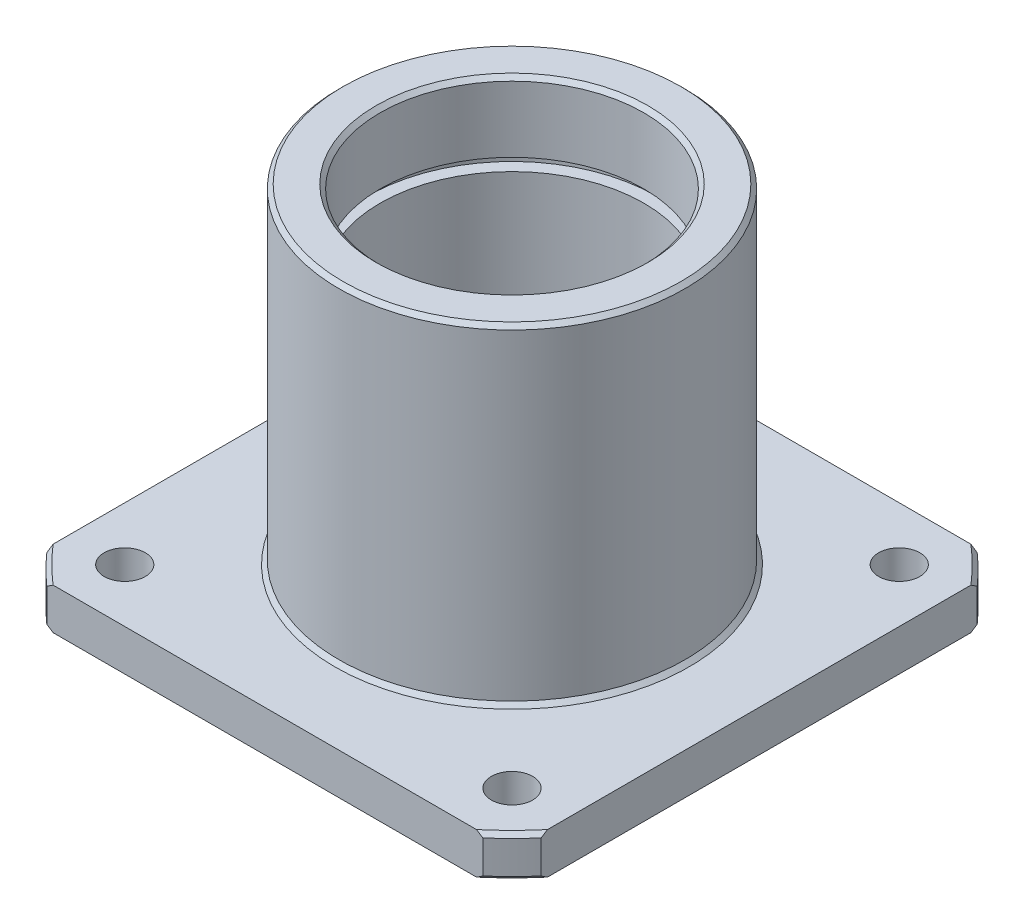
ISO-10303-21;
HEADER;
FILE_DESCRIPTION(('STEP AP214'),'2;1');
FILE_NAME('part.step','',(''),(''),'','','');
FILE_SCHEMA(('AUTOMOTIVE_DESIGN { 1 0 10303 214 1 1 1 1 }'));
ENDSEC;
DATA;
#1=APPLICATION_CONTEXT('core data for automotive mechanical design processes');
#2=APPLICATION_PROTOCOL_DEFINITION('international standard','automotive_design',2000,#1);
#3=PRODUCT_CONTEXT('',#1,'mechanical');
#4=PRODUCT('Part','Part','',(#3));
#5=PRODUCT_RELATED_PRODUCT_CATEGORY('part','',(#4));
#6=PRODUCT_DEFINITION_FORMATION('','',#4);
#7=PRODUCT_DEFINITION_CONTEXT('part definition',#1,'design');
#8=PRODUCT_DEFINITION('design','',#6,#7);
#9=PRODUCT_DEFINITION_SHAPE('','',#8);
#10=(LENGTH_UNIT() NAMED_UNIT(*) SI_UNIT(.MILLI.,.METRE.));
#11=(NAMED_UNIT(*) PLANE_ANGLE_UNIT() SI_UNIT($,.RADIAN.));
#12=(NAMED_UNIT(*) SI_UNIT($,.STERADIAN.) SOLID_ANGLE_UNIT());
#13=UNCERTAINTY_MEASURE_WITH_UNIT(LENGTH_MEASURE(1.E-05),#10,'distance_accuracy_value','');
#14=(GEOMETRIC_REPRESENTATION_CONTEXT(3) GLOBAL_UNCERTAINTY_ASSIGNED_CONTEXT((#13)) GLOBAL_UNIT_ASSIGNED_CONTEXT((#10,
#11,#12)) REPRESENTATION_CONTEXT('',''));
#15=CARTESIAN_POINT('',(0.,0.,0.));
#16=DIRECTION('',(0.,0.,1.));
#17=DIRECTION('',(1.,0.,0.));
#18=AXIS2_PLACEMENT_3D('',#15,#16,#17);
#19=CARTESIAN_POINT('',(0.,0.,0.));
#20=DIRECTION('',(0.,-1.,0.));
#21=DIRECTION('',(0.,0.,-1.));
#22=AXIS2_PLACEMENT_3D('',#19,#20,#21);
#23=CYLINDRICAL_SURFACE('',#22,40.);
#24=CARTESIAN_POINT('',(0.,4.19370497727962,0.));
#25=DIRECTION('',(0.,-1.,0.));
#26=DIRECTION('',(0.,0.,-1.));
#27=AXIS2_PLACEMENT_3D('',#24,#25,#26);
#28=CIRCLE('',#27,40.);
#29=CARTESIAN_POINT('',(-26.4575131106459,4.19370497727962,30.));
#30=VERTEX_POINT('',#29);
#31=CARTESIAN_POINT('',(-30.,4.19370497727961,26.4575131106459));
#32=VERTEX_POINT('',#31);
#33=EDGE_CURVE('E177',#30,#32,#28,.T.);
#34=ORIENTED_EDGE('',*,*,#33,.T.);
#35=DIRECTION('',(0.,-1.,0.));
#36=VECTOR('',#35,1.);
#37=CARTESIAN_POINT('',(-30.,44.6947049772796,26.4575131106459));
#38=LINE('',#37,#36);
#39=CARTESIAN_POINT('',(-30.,0.193704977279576,26.4575131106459));
#40=VERTEX_POINT('',#39);
#41=EDGE_CURVE('E365',#32,#40,#38,.T.);
#42=ORIENTED_EDGE('',*,*,#41,.T.);
#43=CARTESIAN_POINT('',(0.,0.193704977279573,0.));
#44=DIRECTION('',(0.,1.,0.));
#45=DIRECTION('',(0.,0.,1.));
#46=AXIS2_PLACEMENT_3D('',#43,#44,#45);
#47=CIRCLE('',#46,40.);
#48=CARTESIAN_POINT('',(-26.4575131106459,0.193704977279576,30.));
#49=VERTEX_POINT('',#48);
#50=EDGE_CURVE('E176',#40,#49,#47,.T.);
#51=ORIENTED_EDGE('',*,*,#50,.T.);
#52=DIRECTION('',(0.,-1.,0.));
#53=VECTOR('',#52,1.);
#54=CARTESIAN_POINT('',(-26.4575131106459,44.6947049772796,30.));
#55=LINE('',#54,#53);
#56=EDGE_CURVE('E243',#30,#49,#55,.T.);
#57=ORIENTED_EDGE('',*,*,#56,.F.);
#58=EDGE_LOOP('',(#34,#42,#51,#57));
#59=FACE_BOUND('',#58,.T.);
#60=ADVANCED_FACE('F32',(#59),#23,.T.);
#61=CARTESIAN_POINT('',(0.,4.19370497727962,0.));
#62=DIRECTION('',(0.,-1.,0.));
#63=DIRECTION('',(0.,0.,-1.));
#64=AXIS2_PLACEMENT_3D('',#61,#62,#63);
#65=CONICAL_SURFACE('',#64,40.,0.785398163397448);
#66=CARTESIAN_POINT('',(-30.,-21.2905548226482,-58.2081461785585));
#67=CARTESIAN_POINT('',(-30.,-20.5354911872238,-57.3586682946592));
#68=CARTESIAN_POINT('',(-30.,-19.7823339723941,-56.5074904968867));
#69=CARTESIAN_POINT('',(-30.,-18.2803984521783,-54.8012625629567));
#70=CARTESIAN_POINT('',(-30.,-17.531620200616,-53.9462123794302));
#71=CARTESIAN_POINT('',(-30.,-16.0387491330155,-52.2314685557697));
#72=CARTESIAN_POINT('',(-30.,-15.2946581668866,-51.3717733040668));
#73=CARTESIAN_POINT('',(-30.,-13.8121586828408,-49.6474987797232));
#74=CARTESIAN_POINT('',(-30.,-13.073750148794,-48.7829195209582));
#75=CARTESIAN_POINT('',(-30.,-11.5934680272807,-47.0364364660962));
#76=CARTESIAN_POINT('',(-30.,-10.851683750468,-46.1544569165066));
#77=CARTESIAN_POINT('',(-30.,-9.37589221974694,-44.3840164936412));
#78=CARTESIAN_POINT('',(-30.,-8.64188492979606,-43.4955556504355));
#79=CARTESIAN_POINT('',(-30.,-7.18309293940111,-41.7113793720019));
#80=CARTESIAN_POINT('',(-30.,-6.45830644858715,-40.8156654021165));
#81=CARTESIAN_POINT('',(-30.,-5.01941800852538,-39.0156885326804));
#82=CARTESIAN_POINT('',(-30.,-4.30531603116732,-38.1114256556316));
#83=CARTESIAN_POINT('',(-30.,-2.92263092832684,-36.3351805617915));
#84=CARTESIAN_POINT('',(-30.,-2.25347282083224,-35.4636465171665));
#85=CARTESIAN_POINT('',(-30.,-0.928869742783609,-33.7101894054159));
#86=CARTESIAN_POINT('',(-30.,-0.273424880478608,-32.8282662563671));
#87=CARTESIAN_POINT('',(-30.,1.02141822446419,-31.0518350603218));
#88=CARTESIAN_POINT('',(-30.,1.66080603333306,-30.157319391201));
#89=CARTESIAN_POINT('',(-30.,2.91960734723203,-28.3543262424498));
#90=CARTESIAN_POINT('',(-30.,3.53902121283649,-27.4458490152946));
#91=CARTESIAN_POINT('',(-30.,4.75137622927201,-25.6157323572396));
#92=CARTESIAN_POINT('',(-30.,5.34439932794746,-24.6941474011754));
#93=CARTESIAN_POINT('',(-30.,6.50052673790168,-22.832180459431));
#94=CARTESIAN_POINT('',(-30.,7.06362815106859,-21.8917966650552));
#95=CARTESIAN_POINT('',(-30.,8.15185202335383,-19.9905541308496));
#96=CARTESIAN_POINT('',(-30.,8.67701490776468,-19.0297186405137));
#97=CARTESIAN_POINT('',(-30.,9.68043560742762,-17.0839244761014));
#98=CARTESIAN_POINT('',(-30.,10.1587071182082,-16.0989729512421));
#99=CARTESIAN_POINT('',(-30.,10.8159343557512,-14.6371669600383));
#100=CARTESIAN_POINT('',(-30.,11.0180218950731,-14.1706779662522));
#101=CARTESIAN_POINT('',(-30.,11.4080449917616,-13.2318543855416));
#102=CARTESIAN_POINT('',(-30.,11.5959808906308,-12.7595199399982));
#103=CARTESIAN_POINT('',(-30.,12.1363513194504,-11.3334697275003));
#104=CARTESIAN_POINT('',(-30.,12.4653946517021,-10.3706061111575));
#105=CARTESIAN_POINT('',(-30.,12.9014044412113,-8.91190654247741));
#106=CARTESIAN_POINT('',(-30.,13.0368896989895,-8.42446908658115));
#107=CARTESIAN_POINT('',(-30.,13.2874789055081,-7.44440301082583));
#108=CARTESIAN_POINT('',(-30.,13.4025854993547,-6.95177507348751));
#109=CARTESIAN_POINT('',(-30.,13.6108649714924,-5.96189608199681));
#110=CARTESIAN_POINT('',(-30.,13.7040380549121,-5.464645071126));
#111=CARTESIAN_POINT('',(-30.,13.867058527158,-4.46631521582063));
#112=CARTESIAN_POINT('',(-30.,13.9369059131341,-3.96523637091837));
#113=CARTESIAN_POINT('',(-30.,14.0529418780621,-2.9532578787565));
#114=CARTESIAN_POINT('',(-30.,14.0987873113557,-2.44231866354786));
#115=CARTESIAN_POINT('',(-30.,14.1645178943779,-1.418765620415));
#116=CARTESIAN_POINT('',(-30.,14.1844030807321,-0.906151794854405));
#117=CARTESIAN_POINT('',(-30.,14.1978488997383,0.119396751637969));
#118=CARTESIAN_POINT('',(-30.,14.1914108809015,0.63233145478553));
#119=CARTESIAN_POINT('',(-30.,14.1523320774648,1.65719826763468));
#120=CARTESIAN_POINT('',(-30.,14.1196911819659,2.16913037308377));
#121=CARTESIAN_POINT('',(-30.,14.0286617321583,3.19221232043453));
#122=CARTESIAN_POINT('',(-30.,13.9701974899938,3.70335539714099));
#123=CARTESIAN_POINT('',(-30.,13.8285202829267,4.72217843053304));
#124=CARTESIAN_POINT('',(-30.,13.7453073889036,5.22985839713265));
#125=CARTESIAN_POINT('',(-30.,13.5554612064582,6.24087621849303));
#126=CARTESIAN_POINT('',(-30.,13.4488250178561,6.7442135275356));
#127=CARTESIAN_POINT('',(-30.,13.2137093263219,7.74579231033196));
#128=CARTESIAN_POINT('',(-30.,13.0852258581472,8.24403284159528));
#129=CARTESIAN_POINT('',(-30.,12.569301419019,10.0885918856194));
#130=CARTESIAN_POINT('',(-30.,12.117062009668,11.4172310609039));
#131=CARTESIAN_POINT('',(-30.,11.352573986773,13.3754321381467));
#132=CARTESIAN_POINT('',(-30.,11.0832585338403,14.0226375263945));
#133=CARTESIAN_POINT('',(-30.,10.5195986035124,15.3061281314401));
#134=CARTESIAN_POINT('',(-30.,10.2252548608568,15.9424136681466));
#135=CARTESIAN_POINT('',(-30.,9.6120343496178,17.2105512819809));
#136=CARTESIAN_POINT('',(-30.,9.29294839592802,17.8423014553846));
#137=CARTESIAN_POINT('',(-30.,8.63578376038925,19.0958262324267));
#138=CARTESIAN_POINT('',(-30.,8.29770499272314,19.717600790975));
#139=CARTESIAN_POINT('',(-30.,7.60527825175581,20.9517010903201));
#140=CARTESIAN_POINT('',(-30.,7.25093620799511,21.5640301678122));
#141=CARTESIAN_POINT('',(-30.,6.52806955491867,22.7802363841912));
#142=CARTESIAN_POINT('',(-30.,6.15954496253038,23.3841135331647));
#143=CARTESIAN_POINT('',(-30.,5.28888722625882,24.7784181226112));
#144=CARTESIAN_POINT('',(-30.,4.7821221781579,25.5659516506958));
#145=CARTESIAN_POINT('',(-30.,3.75057679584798,27.1291607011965));
#146=CARTESIAN_POINT('',(-30.,3.22579529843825,27.9048354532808));
#147=CARTESIAN_POINT('',(-30.,2.16097038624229,29.4459008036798));
#148=CARTESIAN_POINT('',(-30.,1.62092323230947,30.2112888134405));
#149=CARTESIAN_POINT('',(-30.,0.528020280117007,31.7328238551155));
#150=CARTESIAN_POINT('',(-30.,-0.0248352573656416,32.4889710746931));
#151=CARTESIAN_POINT('',(-30.,-1.14236136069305,33.9943167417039));
#152=CARTESIAN_POINT('',(-30.,-1.70704913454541,34.7435023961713));
#153=CARTESIAN_POINT('',(-30.,-2.84585056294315,36.2346714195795));
#154=CARTESIAN_POINT('',(-30.,-3.4199642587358,36.9766547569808));
#155=CARTESIAN_POINT('',(-30.,-4.57626188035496,38.4541433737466));
#156=CARTESIAN_POINT('',(-30.,-5.15844473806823,39.1896494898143));
#157=CARTESIAN_POINT('',(-30.,-6.3298979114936,40.6549868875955));
#158=CARTESIAN_POINT('',(-30.,-6.91916821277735,41.3848181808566));
#159=CARTESIAN_POINT('',(-30.,-8.62874363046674,43.4838579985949));
#160=CARTESIAN_POINT('',(-30.,-9.75695968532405,44.8466259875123));
#161=CARTESIAN_POINT('',(-30.,-12.030736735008,47.5576708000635));
#162=CARTESIAN_POINT('',(-30.,-13.1762984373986,48.9059470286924));
#163=CARTESIAN_POINT('',(-30.,-14.9029174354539,50.9168714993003));
#164=CARTESIAN_POINT('',(-30.,-15.4787451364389,51.5840199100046));
#165=CARTESIAN_POINT('',(-30.,-16.6335239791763,52.9156100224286));
#166=CARTESIAN_POINT('',(-30.,-17.2124751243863,53.5800517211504));
#167=CARTESIAN_POINT('',(-30.,-18.373141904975,54.9064055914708));
#168=CARTESIAN_POINT('',(-30.,-18.9548572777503,55.5683179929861));
#169=CARTESIAN_POINT('',(-30.,-20.1208485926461,56.889878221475));
#170=CARTESIAN_POINT('',(-30.,-20.7051245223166,57.5495260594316));
#171=CARTESIAN_POINT('',(-30.,-21.2905548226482,58.2081461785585));
#172=B_SPLINE_CURVE_WITH_KNOTS('',3,(#66,#67,#68,#69,#70,#71,#72,#73,#74,#75,#76,#77,#78,#79,
#80,#81,#82,#83,#84,#85,#86,#87,#88,#89,#90,#91,#92,#93,#94,#95,#96,#97,#98,#99,#100,#101,#102,
#103,#104,#105,#106,#107,#108,#109,#110,#111,#112,#113,#114,#115,#116,#117,#118,#119,#120,#121,
#122,#123,#124,#125,#126,#127,#128,#129,#130,#131,#132,#133,#134,#135,#136,#137,#138,#139,#140,
#141,#142,#143,#144,#145,#146,#147,#148,#149,#150,#151,#152,#153,#154,#155,#156,#157,#158,#159,
#160,#161,#162,#163,#164,#165,#166,#167,#168,#169,#170,#171),.UNSPECIFIED.,.F.,.F.,(4,2,2,2,2,2,
2,2,2,2,2,2,2,2,2,2,2,2,2,2,2,2,2,2,2,2,2,2,2,2,2,2,2,2,2,2,2,2,2,2,2,2,2,2,2,2,2,2,2,2,2,2,4),
(0.,3.40963708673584,6.81931599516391,10.2302654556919,13.6412052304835,17.0985049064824,
20.5557885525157,24.0123903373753,27.4689830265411,30.7652465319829,34.0615360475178,
37.3599147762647,40.6582339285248,43.9454718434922,47.2330275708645,50.5170269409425,
53.800064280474,55.3249960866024,56.8498910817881,59.8993486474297,61.4167534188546,
62.9339610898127,64.4511545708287,65.9683482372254,67.5066778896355,69.0450053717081,
70.5832540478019,72.1215092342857,73.6643032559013,75.2070928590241,76.7500735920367,
78.2933346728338,82.4952377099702,84.5979571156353,86.7006148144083,88.8235465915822,
90.9464879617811,93.0686613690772,95.1908322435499,98.0000014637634,100.809352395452,
103.619397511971,106.429385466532,109.243790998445,112.058208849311,114.872257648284,
117.686300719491,122.993646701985,128.301209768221,130.945059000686,133.588911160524,
136.232516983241,138.876109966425),.UNSPECIFIED.);
#173=CARTESIAN_POINT('',(-30.,4.6937049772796,25.6953303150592));
#174=VERTEX_POINT('',#173);
#175=EDGE_CURVE('E150',#174,#32,#172,.T.);
#176=ORIENTED_EDGE('',*,*,#175,.T.);
#177=ORIENTED_EDGE('',*,*,#33,.F.);
#178=CARTESIAN_POINT('',(-58.2081461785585,-21.2905548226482,30.));
#179=CARTESIAN_POINT('',(-57.3586682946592,-20.5354911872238,30.));
#180=CARTESIAN_POINT('',(-56.5074904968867,-19.7823339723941,30.));
#181=CARTESIAN_POINT('',(-54.8012625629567,-18.2803984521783,30.));
#182=CARTESIAN_POINT('',(-53.9462123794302,-17.531620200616,30.));
#183=CARTESIAN_POINT('',(-52.2314685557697,-16.0387491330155,30.));
#184=CARTESIAN_POINT('',(-51.3717733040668,-15.2946581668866,30.));
#185=CARTESIAN_POINT('',(-49.6474987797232,-13.8121586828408,30.));
#186=CARTESIAN_POINT('',(-48.7829195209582,-13.073750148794,30.));
#187=CARTESIAN_POINT('',(-47.0364364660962,-11.5934680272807,30.));
#188=CARTESIAN_POINT('',(-46.1544569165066,-10.851683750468,30.));
#189=CARTESIAN_POINT('',(-44.3840164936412,-9.37589221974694,30.));
#190=CARTESIAN_POINT('',(-43.4955556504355,-8.64188492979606,30.));
#191=CARTESIAN_POINT('',(-41.7113793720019,-7.18309293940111,30.));
#192=CARTESIAN_POINT('',(-40.8156654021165,-6.45830644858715,30.));
#193=CARTESIAN_POINT('',(-39.0156885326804,-5.01941800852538,30.));
#194=CARTESIAN_POINT('',(-38.1114256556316,-4.30531603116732,30.));
#195=CARTESIAN_POINT('',(-36.3351805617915,-2.92263092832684,30.));
#196=CARTESIAN_POINT('',(-35.4636465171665,-2.25347282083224,30.));
#197=CARTESIAN_POINT('',(-33.7101894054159,-0.928869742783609,30.));
#198=CARTESIAN_POINT('',(-32.8282662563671,-0.273424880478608,30.));
#199=CARTESIAN_POINT('',(-31.0518350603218,1.02141822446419,30.));
#200=CARTESIAN_POINT('',(-30.157319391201,1.66080603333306,30.));
#201=CARTESIAN_POINT('',(-28.3543262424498,2.91960734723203,30.));
#202=CARTESIAN_POINT('',(-27.4458490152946,3.53902121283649,30.));
#203=CARTESIAN_POINT('',(-25.6157323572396,4.75137622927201,30.));
#204=CARTESIAN_POINT('',(-24.6941474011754,5.34439932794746,30.));
#205=CARTESIAN_POINT('',(-22.832180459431,6.50052673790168,30.));
#206=CARTESIAN_POINT('',(-21.8917966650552,7.06362815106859,30.));
#207=CARTESIAN_POINT('',(-19.9905541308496,8.15185202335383,30.));
#208=CARTESIAN_POINT('',(-19.0297186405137,8.67701490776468,30.));
#209=CARTESIAN_POINT('',(-17.0839244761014,9.68043560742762,30.));
#210=CARTESIAN_POINT('',(-16.0989729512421,10.1587071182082,30.));
#211=CARTESIAN_POINT('',(-14.6371669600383,10.8159343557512,30.));
#212=CARTESIAN_POINT('',(-14.1706779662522,11.0180218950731,30.));
#213=CARTESIAN_POINT('',(-13.2318543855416,11.4080449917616,30.));
#214=CARTESIAN_POINT('',(-12.7595199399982,11.5959808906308,30.));
#215=CARTESIAN_POINT('',(-11.3334697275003,12.1363513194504,30.));
#216=CARTESIAN_POINT('',(-10.3706061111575,12.4653946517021,30.));
#217=CARTESIAN_POINT('',(-8.91190654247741,12.9014044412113,30.));
#218=CARTESIAN_POINT('',(-8.42446908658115,13.0368896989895,30.));
#219=CARTESIAN_POINT('',(-7.44440301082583,13.2874789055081,30.));
#220=CARTESIAN_POINT('',(-6.95177507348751,13.4025854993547,30.));
#221=CARTESIAN_POINT('',(-5.96189608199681,13.6108649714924,30.));
#222=CARTESIAN_POINT('',(-5.464645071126,13.7040380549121,30.));
#223=CARTESIAN_POINT('',(-4.46631521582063,13.867058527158,30.));
#224=CARTESIAN_POINT('',(-3.96523637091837,13.9369059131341,30.));
#225=CARTESIAN_POINT('',(-2.9532578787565,14.0529418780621,30.));
#226=CARTESIAN_POINT('',(-2.44231866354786,14.0987873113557,30.));
#227=CARTESIAN_POINT('',(-1.418765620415,14.1645178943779,30.));
#228=CARTESIAN_POINT('',(-0.906151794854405,14.1844030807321,30.));
#229=CARTESIAN_POINT('',(0.119396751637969,14.1978488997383,30.));
#230=CARTESIAN_POINT('',(0.63233145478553,14.1914108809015,30.));
#231=CARTESIAN_POINT('',(1.65719826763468,14.1523320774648,30.));
#232=CARTESIAN_POINT('',(2.16913037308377,14.1196911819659,30.));
#233=CARTESIAN_POINT('',(3.19221232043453,14.0286617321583,30.));
#234=CARTESIAN_POINT('',(3.70335539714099,13.9701974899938,30.));
#235=CARTESIAN_POINT('',(4.72217843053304,13.8285202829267,30.));
#236=CARTESIAN_POINT('',(5.22985839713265,13.7453073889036,30.));
#237=CARTESIAN_POINT('',(6.24087621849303,13.5554612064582,30.));
#238=CARTESIAN_POINT('',(6.7442135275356,13.4488250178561,30.));
#239=CARTESIAN_POINT('',(7.74579231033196,13.2137093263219,30.));
#240=CARTESIAN_POINT('',(8.24403284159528,13.0852258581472,30.));
#241=CARTESIAN_POINT('',(10.0885918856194,12.569301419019,30.));
#242=CARTESIAN_POINT('',(11.4172310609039,12.1170620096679,30.));
#243=CARTESIAN_POINT('',(13.3754321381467,11.352573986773,30.));
#244=CARTESIAN_POINT('',(14.0226375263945,11.0832585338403,30.));
#245=CARTESIAN_POINT('',(15.3061281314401,10.5195986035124,30.));
#246=CARTESIAN_POINT('',(15.9424136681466,10.2252548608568,30.));
#247=CARTESIAN_POINT('',(17.2105512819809,9.6120343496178,30.));
#248=CARTESIAN_POINT('',(17.8423014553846,9.29294839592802,30.));
#249=CARTESIAN_POINT('',(19.0958262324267,8.63578376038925,30.));
#250=CARTESIAN_POINT('',(19.717600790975,8.29770499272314,30.));
#251=CARTESIAN_POINT('',(20.9517010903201,7.60527825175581,30.));
#252=CARTESIAN_POINT('',(21.5640301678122,7.25093620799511,30.));
#253=CARTESIAN_POINT('',(22.7802363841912,6.52806955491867,30.));
#254=CARTESIAN_POINT('',(23.3841135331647,6.15954496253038,30.));
#255=CARTESIAN_POINT('',(24.7784181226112,5.28888722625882,30.));
#256=CARTESIAN_POINT('',(25.5659516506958,4.78212217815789,30.));
#257=CARTESIAN_POINT('',(27.1291607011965,3.75057679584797,30.));
#258=CARTESIAN_POINT('',(27.9048354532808,3.22579529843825,30.));
#259=CARTESIAN_POINT('',(29.4459008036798,2.16097038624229,30.));
#260=CARTESIAN_POINT('',(30.2112888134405,1.62092323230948,30.));
#261=CARTESIAN_POINT('',(31.7328238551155,0.52802028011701,30.));
#262=CARTESIAN_POINT('',(32.4889710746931,-0.0248352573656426,30.));
#263=CARTESIAN_POINT('',(33.9943167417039,-1.14236136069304,30.));
#264=CARTESIAN_POINT('',(34.7435023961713,-1.7070491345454,30.));
#265=CARTESIAN_POINT('',(36.2346714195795,-2.84585056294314,30.));
#266=CARTESIAN_POINT('',(36.9766547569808,-3.4199642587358,30.));
#267=CARTESIAN_POINT('',(38.4541433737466,-4.57626188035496,30.));
#268=CARTESIAN_POINT('',(39.1896494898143,-5.15844473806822,30.));
#269=CARTESIAN_POINT('',(40.6549868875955,-6.32989791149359,30.));
#270=CARTESIAN_POINT('',(41.3848181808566,-6.91916821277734,30.));
#271=CARTESIAN_POINT('',(43.4838579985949,-8.62874363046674,30.));
#272=CARTESIAN_POINT('',(44.8466259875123,-9.75695968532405,30.));
#273=CARTESIAN_POINT('',(47.5576708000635,-12.030736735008,30.));
#274=CARTESIAN_POINT('',(48.9059470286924,-13.1762984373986,30.));
#275=CARTESIAN_POINT('',(50.9168714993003,-14.9029174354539,30.));
#276=CARTESIAN_POINT('',(51.5840199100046,-15.4787451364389,30.));
#277=CARTESIAN_POINT('',(52.9156100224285,-16.6335239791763,30.));
#278=CARTESIAN_POINT('',(53.5800517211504,-17.2124751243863,30.));
#279=CARTESIAN_POINT('',(54.9064055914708,-18.373141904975,30.));
#280=CARTESIAN_POINT('',(55.5683179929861,-18.9548572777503,30.));
#281=CARTESIAN_POINT('',(56.889878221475,-20.1208485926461,30.));
#282=CARTESIAN_POINT('',(57.5495260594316,-20.7051245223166,30.));
#283=CARTESIAN_POINT('',(58.2081461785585,-21.2905548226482,30.));
#284=B_SPLINE_CURVE_WITH_KNOTS('',3,(#178,#179,#180,#181,#182,#183,#184,#185,#186,#187,#188,
#189,#190,#191,#192,#193,#194,#195,#196,#197,#198,#199,#200,#201,#202,#203,#204,#205,#206,#207,
#208,#209,#210,#211,#212,#213,#214,#215,#216,#217,#218,#219,#220,#221,#222,#223,#224,#225,#226,
#227,#228,#229,#230,#231,#232,#233,#234,#235,#236,#237,#238,#239,#240,#241,#242,#243,#244,#245,
#246,#247,#248,#249,#250,#251,#252,#253,#254,#255,#256,#257,#258,#259,#260,#261,#262,#263,#264,
#265,#266,#267,#268,#269,#270,#271,#272,#273,#274,#275,#276,#277,#278,#279,#280,#281,#282,#283),
.UNSPECIFIED.,.F.,.F.,(4,2,2,2,2,2,2,2,2,2,2,2,2,2,2,2,2,2,2,2,2,2,2,2,2,2,2,2,2,2,2,2,2,2,2,2,
2,2,2,2,2,2,2,2,2,2,2,2,2,2,2,2,4),(0.,3.40963708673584,6.81931599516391,10.2302654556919,
13.6412052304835,17.0985049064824,20.5557885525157,24.0123903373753,27.4689830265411,
30.7652465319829,34.0615360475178,37.3599147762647,40.6582339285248,43.9454718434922,
47.2330275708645,50.5170269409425,53.800064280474,55.3249960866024,56.8498910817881,
59.8993486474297,61.4167534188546,62.9339610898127,64.4511545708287,65.9683482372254,
67.5066778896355,69.0450053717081,70.5832540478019,72.1215092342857,73.6643032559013,
75.2070928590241,76.7500735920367,78.2933346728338,82.4952377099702,84.5979571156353,
86.7006148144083,88.8235465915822,90.9464879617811,93.0686613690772,95.1908322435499,
98.0000014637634,100.809352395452,103.619397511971,106.429385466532,109.243790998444,
112.058208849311,114.872257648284,117.68630071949,122.993646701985,128.301209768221,
130.945059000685,133.588911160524,136.232516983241,138.876109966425),.UNSPECIFIED.);
#285=CARTESIAN_POINT('',(-25.6953303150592,4.6937049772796,30.));
#286=VERTEX_POINT('',#285);
#287=EDGE_CURVE('E230',#30,#286,#284,.T.);
#288=ORIENTED_EDGE('',*,*,#287,.T.);
#289=CARTESIAN_POINT('',(0.,4.6937049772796,0.));
#290=DIRECTION('',(0.,-1.,0.));
#291=DIRECTION('',(0.,0.,-1.));
#292=AXIS2_PLACEMENT_3D('',#289,#290,#291);
#293=CIRCLE('',#292,39.5);
#294=EDGE_CURVE('E169',#174,#286,#293,.F.);
#295=ORIENTED_EDGE('',*,*,#294,.F.);
#296=EDGE_LOOP('',(#176,#177,#288,#295));
#297=FACE_BOUND('',#296,.T.);
#298=ADVANCED_FACE('F449',(#297),#65,.T.);
#299=CARTESIAN_POINT('',(0.,-0.306295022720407,0.));
#300=DIRECTION('',(0.,1.,0.));
#301=DIRECTION('',(0.,0.,1.));
#302=AXIS2_PLACEMENT_3D('',#299,#300,#301);
#303=CONICAL_SURFACE('',#302,39.5,0.785398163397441);
#304=CARTESIAN_POINT('',(-30.,25.6779647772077,58.2081461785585));
#305=CARTESIAN_POINT('',(-30.,24.9229011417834,57.3586682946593));
#306=CARTESIAN_POINT('',(-30.,24.1697439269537,56.5074904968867));
#307=CARTESIAN_POINT('',(-30.,22.6678084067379,54.8012625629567));
#308=CARTESIAN_POINT('',(-30.,21.9190301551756,53.9462123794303));
#309=CARTESIAN_POINT('',(-30.,20.426159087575,52.2314685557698));
#310=CARTESIAN_POINT('',(-30.,19.6820681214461,51.3717733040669));
#311=CARTESIAN_POINT('',(-30.,18.1995686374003,49.6474987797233));
#312=CARTESIAN_POINT('',(-30.,17.4611601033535,48.7829195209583));
#313=CARTESIAN_POINT('',(-30.,15.9808779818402,47.0364364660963));
#314=CARTESIAN_POINT('',(-30.,15.2390937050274,46.1544569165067));
#315=CARTESIAN_POINT('',(-30.,13.7633021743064,44.3840164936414));
#316=CARTESIAN_POINT('',(-30.,13.0292948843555,43.4955556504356));
#317=CARTESIAN_POINT('',(-30.,11.5705028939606,41.7113793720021));
#318=CARTESIAN_POINT('',(-30.,10.8457164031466,40.8156654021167));
#319=CARTESIAN_POINT('',(-30.,9.40682796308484,39.0156885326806));
#320=CARTESIAN_POINT('',(-30.,8.69272598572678,38.1114256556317));
#321=CARTESIAN_POINT('',(-30.,7.3100408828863,36.3351805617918));
#322=CARTESIAN_POINT('',(-30.,6.6408827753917,35.4636465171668));
#323=CARTESIAN_POINT('',(-30.,5.31627969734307,33.7101894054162));
#324=CARTESIAN_POINT('',(-30.,4.66083483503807,32.8282662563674));
#325=CARTESIAN_POINT('',(-30.,3.36599173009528,31.0518350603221));
#326=CARTESIAN_POINT('',(-30.,2.72660392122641,30.1573193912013));
#327=CARTESIAN_POINT('',(-30.,1.46780260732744,28.3543262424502));
#328=CARTESIAN_POINT('',(-30.,0.848388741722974,27.4458490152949));
#329=CARTESIAN_POINT('',(-30.,-0.363966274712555,25.61573235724));
#330=CARTESIAN_POINT('',(-30.,-0.95698937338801,24.6941474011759));
#331=CARTESIAN_POINT('',(-30.,-2.11311678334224,22.8321804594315));
#332=CARTESIAN_POINT('',(-30.,-2.67621819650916,21.8917966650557));
#333=CARTESIAN_POINT('',(-30.,-3.7644420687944,19.9905541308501));
#334=CARTESIAN_POINT('',(-30.,-4.28960495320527,19.0297186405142));
#335=CARTESIAN_POINT('',(-30.,-5.29302565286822,17.083924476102));
#336=CARTESIAN_POINT('',(-30.,-5.77129716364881,16.0989729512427));
#337=CARTESIAN_POINT('',(-30.,-6.42852440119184,14.637166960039));
#338=CARTESIAN_POINT('',(-30.,-6.63061194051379,14.1706779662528));
#339=CARTESIAN_POINT('',(-30.,-7.0206350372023,13.2318543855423));
#340=CARTESIAN_POINT('',(-30.,-7.2085709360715,12.7595199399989));
#341=CARTESIAN_POINT('',(-30.,-7.74894136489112,11.333469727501));
#342=CARTESIAN_POINT('',(-30.,-8.0779846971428,10.3706061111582));
#343=CARTESIAN_POINT('',(-30.,-8.51399448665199,8.91190654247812));
#344=CARTESIAN_POINT('',(-30.,-8.64947974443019,8.42446908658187));
#345=CARTESIAN_POINT('',(-30.,-8.90006895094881,7.44440301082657));
#346=CARTESIAN_POINT('',(-30.,-9.01517554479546,6.95177507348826));
#347=CARTESIAN_POINT('',(-30.,-9.22345501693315,5.96189608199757));
#348=CARTESIAN_POINT('',(-30.,-9.3166281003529,5.46464507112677));
#349=CARTESIAN_POINT('',(-30.,-9.47964857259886,4.46631521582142));
#350=CARTESIAN_POINT('',(-30.,-9.54949595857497,3.96523637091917));
#351=CARTESIAN_POINT('',(-30.,-9.66553192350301,2.95325787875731));
#352=CARTESIAN_POINT('',(-30.,-9.71137735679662,2.44231866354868));
#353=CARTESIAN_POINT('',(-30.,-9.77710793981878,1.41876562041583));
#354=CARTESIAN_POINT('',(-30.,-9.79699312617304,0.906151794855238));
#355=CARTESIAN_POINT('',(-30.,-9.81043894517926,-0.119396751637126));
#356=CARTESIAN_POINT('',(-30.,-9.80400092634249,-0.632331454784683));
#357=CARTESIAN_POINT('',(-30.,-9.76492212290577,-1.65719826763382));
#358=CARTESIAN_POINT('',(-30.,-9.73228122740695,-2.1691303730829));
#359=CARTESIAN_POINT('',(-30.,-9.6412517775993,-3.19221232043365));
#360=CARTESIAN_POINT('',(-30.,-9.58278753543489,-3.70335539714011));
#361=CARTESIAN_POINT('',(-30.,-9.44111032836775,-4.72217843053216));
#362=CARTESIAN_POINT('',(-30.,-9.35789743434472,-5.22985839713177));
#363=CARTESIAN_POINT('',(-30.,-9.16805125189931,-6.24087621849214));
#364=CARTESIAN_POINT('',(-30.,-9.06141506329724,-6.74421352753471));
#365=CARTESIAN_POINT('',(-30.,-8.82629937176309,-7.74579231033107));
#366=CARTESIAN_POINT('',(-30.,-8.69781590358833,-8.24403284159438));
#367=CARTESIAN_POINT('',(-30.,-8.18189146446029,-10.0885918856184));
#368=CARTESIAN_POINT('',(-30.,-7.72965205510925,-11.4172310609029));
#369=CARTESIAN_POINT('',(-30.,-6.96516403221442,-13.3754321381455));
#370=CARTESIAN_POINT('',(-30.,-6.69584857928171,-14.0226375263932));
#371=CARTESIAN_POINT('',(-30.,-6.1321886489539,-15.3061281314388));
#372=CARTESIAN_POINT('',(-30.,-5.83784490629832,-15.9424136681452));
#373=CARTESIAN_POINT('',(-30.,-5.2246243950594,-17.2105512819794));
#374=CARTESIAN_POINT('',(-30.,-4.90553844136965,-17.8423014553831));
#375=CARTESIAN_POINT('',(-30.,-4.24837380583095,-19.0958262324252));
#376=CARTESIAN_POINT('',(-30.,-3.91029503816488,-19.7176007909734));
#377=CARTESIAN_POINT('',(-30.,-3.21786829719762,-20.9517010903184));
#378=CARTESIAN_POINT('',(-30.,-2.86352625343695,-21.5640301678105));
#379=CARTESIAN_POINT('',(-30.,-2.14065960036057,-22.7802363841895));
#380=CARTESIAN_POINT('',(-30.,-1.77213500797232,-23.3841135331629));
#381=CARTESIAN_POINT('',(-30.,-0.901477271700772,-24.7784181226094));
#382=CARTESIAN_POINT('',(-30.,-0.39471222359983,-25.565951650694));
#383=CARTESIAN_POINT('',(-30.,0.63683315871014,-27.1291607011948));
#384=CARTESIAN_POINT('',(-30.,1.16161465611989,-27.9048354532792));
#385=CARTESIAN_POINT('',(-30.,2.22643956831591,-29.4459008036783));
#386=CARTESIAN_POINT('',(-30.,2.76648672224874,-30.2112888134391));
#387=CARTESIAN_POINT('',(-30.,3.85938967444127,-31.7328238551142));
#388=CARTESIAN_POINT('',(-30.,4.41224521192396,-32.4889710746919));
#389=CARTESIAN_POINT('',(-30.,5.52977131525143,-33.9943167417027));
#390=CARTESIAN_POINT('',(-30.,6.09445908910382,-34.7435023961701));
#391=CARTESIAN_POINT('',(-30.,7.23326051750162,-36.2346714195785));
#392=CARTESIAN_POINT('',(-30.,7.80737421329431,-36.9766547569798));
#393=CARTESIAN_POINT('',(-30.,8.96367183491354,-38.4541433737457));
#394=CARTESIAN_POINT('',(-30.,9.54585469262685,-39.1896494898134));
#395=CARTESIAN_POINT('',(-30.,10.7173078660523,-40.6549868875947));
#396=CARTESIAN_POINT('',(-30.,11.3065781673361,-41.3848181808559));
#397=CARTESIAN_POINT('',(-30.,13.0161535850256,-43.4838579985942));
#398=CARTESIAN_POINT('',(-30.,14.1443696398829,-44.8466259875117));
#399=CARTESIAN_POINT('',(-30.,16.418146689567,-47.557670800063));
#400=CARTESIAN_POINT('',(-30.,17.5637083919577,-48.905947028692));
#401=CARTESIAN_POINT('',(-30.,19.2903273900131,-50.9168714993));
#402=CARTESIAN_POINT('',(-30.,19.8661550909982,-51.5840199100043));
#403=CARTESIAN_POINT('',(-30.,21.0209339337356,-52.9156100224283));
#404=CARTESIAN_POINT('',(-30.,21.5998850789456,-53.5800517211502));
#405=CARTESIAN_POINT('',(-30.,22.7605518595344,-54.9064055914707));
#406=CARTESIAN_POINT('',(-30.,23.3422672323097,-55.568317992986));
#407=CARTESIAN_POINT('',(-30.,24.5082585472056,-56.8898782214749));
#408=CARTESIAN_POINT('',(-30.,25.0925344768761,-57.5495260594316));
#409=CARTESIAN_POINT('',(-30.,25.6779647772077,-58.2081461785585));
#410=B_SPLINE_CURVE_WITH_KNOTS('',3,(#304,#305,#306,#307,#308,#309,#310,#311,#312,#313,#314,
#315,#316,#317,#318,#319,#320,#321,#322,#323,#324,#325,#326,#327,#328,#329,#330,#331,#332,#333,
#334,#335,#336,#337,#338,#339,#340,#341,#342,#343,#344,#345,#346,#347,#348,#349,#350,#351,#352,
#353,#354,#355,#356,#357,#358,#359,#360,#361,#362,#363,#364,#365,#366,#367,#368,#369,#370,#371,
#372,#373,#374,#375,#376,#377,#378,#379,#380,#381,#382,#383,#384,#385,#386,#387,#388,#389,#390,
#391,#392,#393,#394,#395,#396,#397,#398,#399,#400,#401,#402,#403,#404,#405,#406,#407,#408,#409),
.UNSPECIFIED.,.F.,.F.,(4,2,2,2,2,2,2,2,2,2,2,2,2,2,2,2,2,2,2,2,2,2,2,2,2,2,2,2,2,2,2,2,2,2,2,2,
2,2,2,2,2,2,2,2,2,2,2,2,2,2,2,2,4),(0.,3.40963708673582,6.81931599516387,10.2302654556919,
13.6412052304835,17.0985049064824,20.5557885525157,24.0123903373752,27.468983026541,
30.7652465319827,34.0615360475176,37.3599147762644,40.6582339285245,43.945471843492,
47.2330275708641,50.5170269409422,53.8000642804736,55.324996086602,56.8498910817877,
59.8993486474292,61.4167534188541,62.9339610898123,64.4511545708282,65.9683482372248,
67.5066778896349,69.0450053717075,70.5832540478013,72.1215092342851,73.6643032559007,
75.2070928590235,76.750073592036,78.2933346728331,82.4952377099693,84.5979571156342,
86.700614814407,88.8235465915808,90.9464879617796,93.0686613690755,95.1908322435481,
98.0000014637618,100.80935239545,103.61939751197,106.429385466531,109.243790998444,
112.05820884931,114.872257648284,117.68630071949,122.993646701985,128.301209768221,
130.945059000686,133.588911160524,136.232516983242,138.876109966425),.UNSPECIFIED.);
#411=CARTESIAN_POINT('',(-30.,-0.306295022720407,-25.6953303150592));
#412=VERTEX_POINT('',#411);
#413=CARTESIAN_POINT('',(-30.,0.193704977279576,-26.4575131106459));
#414=VERTEX_POINT('',#413);
#415=EDGE_CURVE('E384',#412,#414,#410,.T.);
#416=ORIENTED_EDGE('',*,*,#415,.T.);
#417=CARTESIAN_POINT('',(-26.4575131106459,0.193704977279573,-30.));
#418=VERTEX_POINT('',#417);
#419=EDGE_CURVE('E363',#418,#414,#47,.T.);
#420=ORIENTED_EDGE('',*,*,#419,.F.);
#421=CARTESIAN_POINT('',(-58.2081461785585,25.6779647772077,-30.));
#422=CARTESIAN_POINT('',(-57.3586682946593,24.9229011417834,-30.));
#423=CARTESIAN_POINT('',(-56.5074904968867,24.1697439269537,-30.));
#424=CARTESIAN_POINT('',(-54.8012625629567,22.6678084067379,-30.));
#425=CARTESIAN_POINT('',(-53.9462123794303,21.9190301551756,-30.));
#426=CARTESIAN_POINT('',(-52.2314685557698,20.426159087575,-30.));
#427=CARTESIAN_POINT('',(-51.3717733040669,19.6820681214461,-30.));
#428=CARTESIAN_POINT('',(-49.6474987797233,18.1995686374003,-30.));
#429=CARTESIAN_POINT('',(-48.7829195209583,17.4611601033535,-30.));
#430=CARTESIAN_POINT('',(-47.0364364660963,15.9808779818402,-30.));
#431=CARTESIAN_POINT('',(-46.1544569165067,15.2390937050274,-30.));
#432=CARTESIAN_POINT('',(-44.3840164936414,13.7633021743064,-30.));
#433=CARTESIAN_POINT('',(-43.4955556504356,13.0292948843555,-30.));
#434=CARTESIAN_POINT('',(-41.7113793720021,11.5705028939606,-30.));
#435=CARTESIAN_POINT('',(-40.8156654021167,10.8457164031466,-30.));
#436=CARTESIAN_POINT('',(-39.0156885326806,9.40682796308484,-30.));
#437=CARTESIAN_POINT('',(-38.1114256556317,8.69272598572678,-30.));
#438=CARTESIAN_POINT('',(-36.3351805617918,7.3100408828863,-30.));
#439=CARTESIAN_POINT('',(-35.4636465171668,6.6408827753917,-30.));
#440=CARTESIAN_POINT('',(-33.7101894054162,5.31627969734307,-30.));
#441=CARTESIAN_POINT('',(-32.8282662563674,4.66083483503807,-30.));
#442=CARTESIAN_POINT('',(-31.0518350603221,3.36599173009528,-30.));
#443=CARTESIAN_POINT('',(-30.1573193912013,2.72660392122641,-30.));
#444=CARTESIAN_POINT('',(-28.3543262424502,1.46780260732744,-30.));
#445=CARTESIAN_POINT('',(-27.4458490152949,0.848388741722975,-30.));
#446=CARTESIAN_POINT('',(-25.61573235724,-0.363966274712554,-30.));
#447=CARTESIAN_POINT('',(-24.6941474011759,-0.956989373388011,-30.));
#448=CARTESIAN_POINT('',(-22.8321804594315,-2.11311678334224,-30.));
#449=CARTESIAN_POINT('',(-21.8917966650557,-2.67621819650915,-30.));
#450=CARTESIAN_POINT('',(-19.9905541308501,-3.7644420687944,-30.));
#451=CARTESIAN_POINT('',(-19.0297186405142,-4.28960495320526,-30.));
#452=CARTESIAN_POINT('',(-17.083924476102,-5.29302565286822,-30.));
#453=CARTESIAN_POINT('',(-16.0989729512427,-5.77129716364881,-30.));
#454=CARTESIAN_POINT('',(-14.637166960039,-6.42852440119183,-30.));
#455=CARTESIAN_POINT('',(-14.1706779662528,-6.63061194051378,-30.));
#456=CARTESIAN_POINT('',(-13.2318543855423,-7.02063503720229,-30.));
#457=CARTESIAN_POINT('',(-12.7595199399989,-7.20857093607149,-30.));
#458=CARTESIAN_POINT('',(-11.333469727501,-7.74894136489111,-30.));
#459=CARTESIAN_POINT('',(-10.3706061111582,-8.0779846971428,-30.));
#460=CARTESIAN_POINT('',(-8.91190654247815,-8.51399448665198,-30.));
#461=CARTESIAN_POINT('',(-8.4244690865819,-8.64947974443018,-30.));
#462=CARTESIAN_POINT('',(-7.4444030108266,-8.9000689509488,-30.));
#463=CARTESIAN_POINT('',(-6.95177507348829,-9.01517554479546,-30.));
#464=CARTESIAN_POINT('',(-5.9618960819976,-9.22345501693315,-30.));
#465=CARTESIAN_POINT('',(-5.46464507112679,-9.3166281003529,-30.));
#466=CARTESIAN_POINT('',(-4.46631521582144,-9.47964857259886,-30.));
#467=CARTESIAN_POINT('',(-3.96523637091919,-9.54949595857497,-30.));
#468=CARTESIAN_POINT('',(-2.95325787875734,-9.66553192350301,-30.));
#469=CARTESIAN_POINT('',(-2.44231866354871,-9.71137735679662,-30.));
#470=CARTESIAN_POINT('',(-1.41876562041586,-9.77710793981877,-30.));
#471=CARTESIAN_POINT('',(-0.906151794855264,-9.79699312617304,-30.));
#472=CARTESIAN_POINT('',(0.119396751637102,-9.81043894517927,-30.));
#473=CARTESIAN_POINT('',(0.632331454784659,-9.80400092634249,-30.));
#474=CARTESIAN_POINT('',(1.6571982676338,-9.76492212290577,-30.));
#475=CARTESIAN_POINT('',(2.16913037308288,-9.73228122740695,-30.));
#476=CARTESIAN_POINT('',(3.19221232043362,-9.64125177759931,-30.));
#477=CARTESIAN_POINT('',(3.70335539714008,-9.5827875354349,-30.));
#478=CARTESIAN_POINT('',(4.72217843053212,-9.44111032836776,-30.));
#479=CARTESIAN_POINT('',(5.22985839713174,-9.35789743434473,-30.));
#480=CARTESIAN_POINT('',(6.24087621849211,-9.16805125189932,-30.));
#481=CARTESIAN_POINT('',(6.74421352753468,-9.06141506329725,-30.));
#482=CARTESIAN_POINT('',(7.74579231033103,-8.8262993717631,-30.));
#483=CARTESIAN_POINT('',(8.24403284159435,-8.69781590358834,-30.));
#484=CARTESIAN_POINT('',(10.0885918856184,-8.1818914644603,-30.));
#485=CARTESIAN_POINT('',(11.4172310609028,-7.72965205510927,-30.));
#486=CARTESIAN_POINT('',(13.3754321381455,-6.96516403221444,-30.));
#487=CARTESIAN_POINT('',(14.0226375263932,-6.69584857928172,-30.));
#488=CARTESIAN_POINT('',(15.3061281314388,-6.13218864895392,-30.));
#489=CARTESIAN_POINT('',(15.9424136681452,-5.83784490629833,-30.));
#490=CARTESIAN_POINT('',(17.2105512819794,-5.22462439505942,-30.));
#491=CARTESIAN_POINT('',(17.842301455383,-4.90553844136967,-30.));
#492=CARTESIAN_POINT('',(19.0958262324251,-4.24837380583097,-30.));
#493=CARTESIAN_POINT('',(19.7176007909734,-3.9102950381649,-30.));
#494=CARTESIAN_POINT('',(20.9517010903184,-3.21786829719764,-30.));
#495=CARTESIAN_POINT('',(21.5640301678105,-2.86352625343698,-30.));
#496=CARTESIAN_POINT('',(22.7802363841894,-2.14065960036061,-30.));
#497=CARTESIAN_POINT('',(23.3841135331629,-1.77213500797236,-30.));
#498=CARTESIAN_POINT('',(24.7784181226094,-0.901477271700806,-30.));
#499=CARTESIAN_POINT('',(25.565951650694,-0.394712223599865,-30.));
#500=CARTESIAN_POINT('',(27.1291607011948,0.636833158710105,-30.));
#501=CARTESIAN_POINT('',(27.9048354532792,1.16161465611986,-30.));
#502=CARTESIAN_POINT('',(29.4459008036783,2.22643956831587,-30.));
#503=CARTESIAN_POINT('',(30.211288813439,2.76648672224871,-30.));
#504=CARTESIAN_POINT('',(31.7328238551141,3.85938967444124,-30.));
#505=CARTESIAN_POINT('',(32.4889710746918,4.41224521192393,-30.));
#506=CARTESIAN_POINT('',(33.9943167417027,5.5297713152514,-30.));
#507=CARTESIAN_POINT('',(34.7435023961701,6.09445908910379,-30.));
#508=CARTESIAN_POINT('',(36.2346714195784,7.2332605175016,-30.));
#509=CARTESIAN_POINT('',(36.9766547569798,7.80737421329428,-30.));
#510=CARTESIAN_POINT('',(38.4541433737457,8.96367183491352,-30.));
#511=CARTESIAN_POINT('',(39.1896494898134,9.54585469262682,-30.));
#512=CARTESIAN_POINT('',(40.6549868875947,10.7173078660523,-30.));
#513=CARTESIAN_POINT('',(41.3848181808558,11.3065781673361,-30.));
#514=CARTESIAN_POINT('',(43.4838579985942,13.0161535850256,-30.));
#515=CARTESIAN_POINT('',(44.8466259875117,14.1443696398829,-30.));
#516=CARTESIAN_POINT('',(47.557670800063,16.418146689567,-30.));
#517=CARTESIAN_POINT('',(48.905947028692,17.5637083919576,-30.));
#518=CARTESIAN_POINT('',(50.9168714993,19.2903273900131,-30.));
#519=CARTESIAN_POINT('',(51.5840199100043,19.8661550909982,-30.));
#520=CARTESIAN_POINT('',(52.9156100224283,21.0209339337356,-30.));
#521=CARTESIAN_POINT('',(53.5800517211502,21.5998850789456,-30.));
#522=CARTESIAN_POINT('',(54.9064055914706,22.7605518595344,-30.));
#523=CARTESIAN_POINT('',(55.568317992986,23.3422672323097,-30.));
#524=CARTESIAN_POINT('',(56.8898782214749,24.5082585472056,-30.));
#525=CARTESIAN_POINT('',(57.5495260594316,25.0925344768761,-30.));
#526=CARTESIAN_POINT('',(58.2081461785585,25.6779647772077,-30.));
#527=B_SPLINE_CURVE_WITH_KNOTS('',3,(#421,#422,#423,#424,#425,#426,#427,#428,#429,#430,#431,
#432,#433,#434,#435,#436,#437,#438,#439,#440,#441,#442,#443,#444,#445,#446,#447,#448,#449,#450,
#451,#452,#453,#454,#455,#456,#457,#458,#459,#460,#461,#462,#463,#464,#465,#466,#467,#468,#469,
#470,#471,#472,#473,#474,#475,#476,#477,#478,#479,#480,#481,#482,#483,#484,#485,#486,#487,#488,
#489,#490,#491,#492,#493,#494,#495,#496,#497,#498,#499,#500,#501,#502,#503,#504,#505,#506,#507,
#508,#509,#510,#511,#512,#513,#514,#515,#516,#517,#518,#519,#520,#521,#522,#523,#524,#525,#526),
.UNSPECIFIED.,.F.,.F.,(4,2,2,2,2,2,2,2,2,2,2,2,2,2,2,2,2,2,2,2,2,2,2,2,2,2,2,2,2,2,2,2,2,2,2,2,
2,2,2,2,2,2,2,2,2,2,2,2,2,2,2,2,4),(0.,3.40963708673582,6.81931599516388,10.2302654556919,
13.6412052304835,17.0985049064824,20.5557885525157,24.0123903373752,27.468983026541,
30.7652465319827,34.0615360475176,37.3599147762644,40.6582339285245,43.945471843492,
47.2330275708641,50.5170269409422,53.8000642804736,55.324996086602,56.8498910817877,
59.8993486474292,61.4167534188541,62.9339610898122,64.4511545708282,65.9683482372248,
67.5066778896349,69.0450053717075,70.5832540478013,72.1215092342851,73.6643032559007,
75.2070928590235,76.750073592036,78.2933346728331,82.4952377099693,84.5979571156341,
86.700614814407,88.8235465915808,90.9464879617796,93.0686613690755,95.1908322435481,
98.0000014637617,100.80935239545,103.61939751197,106.429385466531,109.243790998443,
112.05820884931,114.872257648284,117.68630071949,122.993646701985,128.301209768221,
130.945059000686,133.588911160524,136.232516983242,138.876109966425),.UNSPECIFIED.);
#528=CARTESIAN_POINT('',(-25.6953303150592,-0.306295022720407,-30.));
#529=VERTEX_POINT('',#528);
#530=EDGE_CURVE('E324',#418,#529,#527,.T.);
#531=ORIENTED_EDGE('',*,*,#530,.T.);
#532=CARTESIAN_POINT('',(0.,-0.306295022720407,0.));
#533=DIRECTION('',(0.,1.,0.));
#534=DIRECTION('',(0.,0.,1.));
#535=AXIS2_PLACEMENT_3D('',#532,#533,#534);
#536=CIRCLE('',#535,39.5);
#537=EDGE_CURVE('E54',#412,#529,#536,.F.);
#538=ORIENTED_EDGE('',*,*,#537,.F.);
#539=EDGE_LOOP('',(#416,#420,#531,#538));
#540=FACE_BOUND('',#539,.T.);
#541=ADVANCED_FACE('F452',(#540),#303,.T.);
#542=ORIENTED_EDGE('',*,*,#419,.T.);
#543=DIRECTION('',(0.,-1.,0.));
#544=VECTOR('',#543,1.);
#545=CARTESIAN_POINT('',(-30.,44.6947049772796,-26.4575131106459));
#546=LINE('',#545,#544);
#547=CARTESIAN_POINT('',(-30.,4.19370497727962,-26.4575131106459));
#548=VERTEX_POINT('',#547);
#549=EDGE_CURVE('E319',#548,#414,#546,.T.);
#550=ORIENTED_EDGE('',*,*,#549,.F.);
#551=CARTESIAN_POINT('',(-26.4575131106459,4.19370497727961,-30.));
#552=VERTEX_POINT('',#551);
#553=EDGE_CURVE('E161',#548,#552,#28,.T.);
#554=ORIENTED_EDGE('',*,*,#553,.T.);
#555=DIRECTION('',(0.,-1.,0.));
#556=VECTOR('',#555,1.);
#557=CARTESIAN_POINT('',(-26.4575131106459,44.6947049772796,-30.));
#558=LINE('',#557,#556);
#559=EDGE_CURVE('E317',#552,#418,#558,.T.);
#560=ORIENTED_EDGE('',*,*,#559,.T.);
#561=EDGE_LOOP('',(#542,#550,#554,#560));
#562=FACE_BOUND('',#561,.T.);
#563=ADVANCED_FACE('F316',(#562),#23,.T.);
#564=CARTESIAN_POINT('',(-30.,4.6937049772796,-25.6953303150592));
#565=VERTEX_POINT('',#564);
#566=EDGE_CURVE('E147',#548,#565,#172,.T.);
#567=ORIENTED_EDGE('',*,*,#566,.T.);
#568=CARTESIAN_POINT('',(-25.6953303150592,4.6937049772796,-30.));
#569=VERTEX_POINT('',#568);
#570=EDGE_CURVE('E160',#569,#565,#293,.F.);
#571=ORIENTED_EDGE('',*,*,#570,.F.);
#572=CARTESIAN_POINT('',(58.2081461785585,-21.2905548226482,-30.));
#573=CARTESIAN_POINT('',(57.3586682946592,-20.5354911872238,-30.));
#574=CARTESIAN_POINT('',(56.5074904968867,-19.7823339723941,-30.));
#575=CARTESIAN_POINT('',(54.8012625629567,-18.2803984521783,-30.));
#576=CARTESIAN_POINT('',(53.9462123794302,-17.531620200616,-30.));
#577=CARTESIAN_POINT('',(52.2314685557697,-16.0387491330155,-30.));
#578=CARTESIAN_POINT('',(51.3717733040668,-15.2946581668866,-30.));
#579=CARTESIAN_POINT('',(49.6474987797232,-13.8121586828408,-30.));
#580=CARTESIAN_POINT('',(48.7829195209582,-13.073750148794,-30.));
#581=CARTESIAN_POINT('',(47.0364364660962,-11.5934680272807,-30.));
#582=CARTESIAN_POINT('',(46.1544569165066,-10.851683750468,-30.));
#583=CARTESIAN_POINT('',(44.3840164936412,-9.37589221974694,-30.));
#584=CARTESIAN_POINT('',(43.4955556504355,-8.64188492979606,-30.));
#585=CARTESIAN_POINT('',(41.7113793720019,-7.18309293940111,-30.));
#586=CARTESIAN_POINT('',(40.8156654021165,-6.45830644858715,-30.));
#587=CARTESIAN_POINT('',(39.0156885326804,-5.01941800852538,-30.));
#588=CARTESIAN_POINT('',(38.1114256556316,-4.30531603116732,-30.));
#589=CARTESIAN_POINT('',(36.3351805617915,-2.92263092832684,-30.));
#590=CARTESIAN_POINT('',(35.4636465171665,-2.25347282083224,-30.));
#591=CARTESIAN_POINT('',(33.7101894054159,-0.928869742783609,-30.));
#592=CARTESIAN_POINT('',(32.8282662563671,-0.273424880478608,-30.));
#593=CARTESIAN_POINT('',(31.0518350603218,1.02141822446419,-30.));
#594=CARTESIAN_POINT('',(30.157319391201,1.66080603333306,-30.));
#595=CARTESIAN_POINT('',(28.3543262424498,2.91960734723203,-30.));
#596=CARTESIAN_POINT('',(27.4458490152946,3.53902121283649,-30.));
#597=CARTESIAN_POINT('',(25.6157323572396,4.75137622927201,-30.));
#598=CARTESIAN_POINT('',(24.6941474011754,5.34439932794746,-30.));
#599=CARTESIAN_POINT('',(22.832180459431,6.50052673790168,-30.));
#600=CARTESIAN_POINT('',(21.8917966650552,7.06362815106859,-30.));
#601=CARTESIAN_POINT('',(19.9905541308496,8.15185202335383,-30.));
#602=CARTESIAN_POINT('',(19.0297186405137,8.67701490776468,-30.));
#603=CARTESIAN_POINT('',(17.0839244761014,9.68043560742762,-30.));
#604=CARTESIAN_POINT('',(16.0989729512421,10.1587071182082,-30.));
#605=CARTESIAN_POINT('',(14.6371669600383,10.8159343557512,-30.));
#606=CARTESIAN_POINT('',(14.1706779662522,11.0180218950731,-30.));
#607=CARTESIAN_POINT('',(13.2318543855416,11.4080449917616,-30.));
#608=CARTESIAN_POINT('',(12.7595199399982,11.5959808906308,-30.));
#609=CARTESIAN_POINT('',(11.3334697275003,12.1363513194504,-30.));
#610=CARTESIAN_POINT('',(10.3706061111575,12.4653946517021,-30.));
#611=CARTESIAN_POINT('',(8.91190654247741,12.9014044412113,-30.));
#612=CARTESIAN_POINT('',(8.42446908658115,13.0368896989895,-30.));
#613=CARTESIAN_POINT('',(7.44440301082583,13.2874789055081,-30.));
#614=CARTESIAN_POINT('',(6.95177507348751,13.4025854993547,-30.));
#615=CARTESIAN_POINT('',(5.96189608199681,13.6108649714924,-30.));
#616=CARTESIAN_POINT('',(5.464645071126,13.7040380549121,-30.));
#617=CARTESIAN_POINT('',(4.46631521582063,13.867058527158,-30.));
#618=CARTESIAN_POINT('',(3.96523637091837,13.9369059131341,-30.));
#619=CARTESIAN_POINT('',(2.9532578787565,14.0529418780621,-30.));
#620=CARTESIAN_POINT('',(2.44231866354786,14.0987873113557,-30.));
#621=CARTESIAN_POINT('',(1.418765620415,14.1645178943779,-30.));
#622=CARTESIAN_POINT('',(0.906151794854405,14.1844030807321,-30.));
#623=CARTESIAN_POINT('',(-0.119396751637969,14.1978488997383,-30.));
#624=CARTESIAN_POINT('',(-0.63233145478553,14.1914108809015,-30.));
#625=CARTESIAN_POINT('',(-1.65719826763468,14.1523320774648,-30.));
#626=CARTESIAN_POINT('',(-2.16913037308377,14.1196911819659,-30.));
#627=CARTESIAN_POINT('',(-3.19221232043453,14.0286617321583,-30.));
#628=CARTESIAN_POINT('',(-3.70335539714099,13.9701974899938,-30.));
#629=CARTESIAN_POINT('',(-4.72217843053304,13.8285202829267,-30.));
#630=CARTESIAN_POINT('',(-5.22985839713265,13.7453073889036,-30.));
#631=CARTESIAN_POINT('',(-6.24087621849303,13.5554612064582,-30.));
#632=CARTESIAN_POINT('',(-6.7442135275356,13.4488250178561,-30.));
#633=CARTESIAN_POINT('',(-7.74579231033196,13.2137093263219,-30.));
#634=CARTESIAN_POINT('',(-8.24403284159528,13.0852258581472,-30.));
#635=CARTESIAN_POINT('',(-10.0885918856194,12.569301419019,-30.));
#636=CARTESIAN_POINT('',(-11.4172310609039,12.1170620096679,-30.));
#637=CARTESIAN_POINT('',(-13.3754321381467,11.352573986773,-30.));
#638=CARTESIAN_POINT('',(-14.0226375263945,11.0832585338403,-30.));
#639=CARTESIAN_POINT('',(-15.3061281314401,10.5195986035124,-30.));
#640=CARTESIAN_POINT('',(-15.9424136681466,10.2252548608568,-30.));
#641=CARTESIAN_POINT('',(-17.2105512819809,9.6120343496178,-30.));
#642=CARTESIAN_POINT('',(-17.8423014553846,9.29294839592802,-30.));
#643=CARTESIAN_POINT('',(-19.0958262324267,8.63578376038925,-30.));
#644=CARTESIAN_POINT('',(-19.717600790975,8.29770499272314,-30.));
#645=CARTESIAN_POINT('',(-20.9517010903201,7.60527825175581,-30.));
#646=CARTESIAN_POINT('',(-21.5640301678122,7.25093620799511,-30.));
#647=CARTESIAN_POINT('',(-22.7802363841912,6.52806955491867,-30.));
#648=CARTESIAN_POINT('',(-23.3841135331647,6.15954496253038,-30.));
#649=CARTESIAN_POINT('',(-24.7784181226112,5.28888722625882,-30.));
#650=CARTESIAN_POINT('',(-25.5659516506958,4.78212217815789,-30.));
#651=CARTESIAN_POINT('',(-27.1291607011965,3.75057679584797,-30.));
#652=CARTESIAN_POINT('',(-27.9048354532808,3.22579529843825,-30.));
#653=CARTESIAN_POINT('',(-29.4459008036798,2.16097038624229,-30.));
#654=CARTESIAN_POINT('',(-30.2112888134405,1.62092323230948,-30.));
#655=CARTESIAN_POINT('',(-31.7328238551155,0.52802028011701,-30.));
#656=CARTESIAN_POINT('',(-32.4889710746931,-0.0248352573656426,-30.));
#657=CARTESIAN_POINT('',(-33.9943167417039,-1.14236136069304,-30.));
#658=CARTESIAN_POINT('',(-34.7435023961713,-1.7070491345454,-30.));
#659=CARTESIAN_POINT('',(-36.2346714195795,-2.84585056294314,-30.));
#660=CARTESIAN_POINT('',(-36.9766547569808,-3.4199642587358,-30.));
#661=CARTESIAN_POINT('',(-38.4541433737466,-4.57626188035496,-30.));
#662=CARTESIAN_POINT('',(-39.1896494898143,-5.15844473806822,-30.));
#663=CARTESIAN_POINT('',(-40.6549868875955,-6.32989791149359,-30.));
#664=CARTESIAN_POINT('',(-41.3848181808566,-6.91916821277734,-30.));
#665=CARTESIAN_POINT('',(-43.4838579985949,-8.62874363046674,-30.));
#666=CARTESIAN_POINT('',(-44.8466259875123,-9.75695968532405,-30.));
#667=CARTESIAN_POINT('',(-47.5576708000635,-12.030736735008,-30.));
#668=CARTESIAN_POINT('',(-48.9059470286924,-13.1762984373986,-30.));
#669=CARTESIAN_POINT('',(-50.9168714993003,-14.9029174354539,-30.));
#670=CARTESIAN_POINT('',(-51.5840199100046,-15.4787451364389,-30.));
#671=CARTESIAN_POINT('',(-52.9156100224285,-16.6335239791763,-30.));
#672=CARTESIAN_POINT('',(-53.5800517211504,-17.2124751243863,-30.));
#673=CARTESIAN_POINT('',(-54.9064055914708,-18.373141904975,-30.));
#674=CARTESIAN_POINT('',(-55.5683179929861,-18.9548572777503,-30.));
#675=CARTESIAN_POINT('',(-56.889878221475,-20.1208485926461,-30.));
#676=CARTESIAN_POINT('',(-57.5495260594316,-20.7051245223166,-30.));
#677=CARTESIAN_POINT('',(-58.2081461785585,-21.2905548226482,-30.));
#678=B_SPLINE_CURVE_WITH_KNOTS('',3,(#572,#573,#574,#575,#576,#577,#578,#579,#580,#581,#582,
#583,#584,#585,#586,#587,#588,#589,#590,#591,#592,#593,#594,#595,#596,#597,#598,#599,#600,#601,
#602,#603,#604,#605,#606,#607,#608,#609,#610,#611,#612,#613,#614,#615,#616,#617,#618,#619,#620,
#621,#622,#623,#624,#625,#626,#627,#628,#629,#630,#631,#632,#633,#634,#635,#636,#637,#638,#639,
#640,#641,#642,#643,#644,#645,#646,#647,#648,#649,#650,#651,#652,#653,#654,#655,#656,#657,#658,
#659,#660,#661,#662,#663,#664,#665,#666,#667,#668,#669,#670,#671,#672,#673,#674,#675,#676,#677),
.UNSPECIFIED.,.F.,.F.,(4,2,2,2,2,2,2,2,2,2,2,2,2,2,2,2,2,2,2,2,2,2,2,2,2,2,2,2,2,2,2,2,2,2,2,2,
2,2,2,2,2,2,2,2,2,2,2,2,2,2,2,2,4),(0.,3.40963708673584,6.81931599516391,10.2302654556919,
13.6412052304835,17.0985049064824,20.5557885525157,24.0123903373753,27.4689830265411,
30.7652465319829,34.0615360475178,37.3599147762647,40.6582339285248,43.9454718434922,
47.2330275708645,50.5170269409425,53.800064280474,55.3249960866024,56.8498910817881,
59.8993486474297,61.4167534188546,62.9339610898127,64.4511545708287,65.9683482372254,
67.5066778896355,69.0450053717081,70.5832540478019,72.1215092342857,73.6643032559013,
75.2070928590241,76.7500735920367,78.2933346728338,82.4952377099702,84.5979571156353,
86.7006148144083,88.8235465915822,90.9464879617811,93.0686613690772,95.1908322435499,
98.0000014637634,100.809352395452,103.619397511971,106.429385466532,109.243790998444,
112.058208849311,114.872257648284,117.68630071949,122.993646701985,128.301209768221,
130.945059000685,133.588911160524,136.232516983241,138.876109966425),.UNSPECIFIED.);
#679=EDGE_CURVE('E322',#569,#552,#678,.T.);
#680=ORIENTED_EDGE('',*,*,#679,.T.);
#681=ORIENTED_EDGE('',*,*,#553,.F.);
#682=EDGE_LOOP('',(#567,#571,#680,#681));
#683=FACE_BOUND('',#682,.T.);
#684=ADVANCED_FACE('F158',(#683),#65,.T.);
#685=CARTESIAN_POINT('',(25.6953303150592,-0.306295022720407,-30.));
#686=VERTEX_POINT('',#685);
#687=CARTESIAN_POINT('',(26.4575131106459,0.193704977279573,-30.));
#688=VERTEX_POINT('',#687);
#689=EDGE_CURVE('E162',#686,#688,#527,.T.);
#690=ORIENTED_EDGE('',*,*,#689,.T.);
#691=CARTESIAN_POINT('',(30.,0.193704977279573,-26.4575131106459));
#692=VERTEX_POINT('',#691);
#693=EDGE_CURVE('E175',#692,#688,#47,.T.);
#694=ORIENTED_EDGE('',*,*,#693,.F.);
#695=CARTESIAN_POINT('',(30.,25.6779647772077,-58.2081461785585));
#696=CARTESIAN_POINT('',(30.,24.9229011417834,-57.3586682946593));
#697=CARTESIAN_POINT('',(30.,24.1697439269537,-56.5074904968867));
#698=CARTESIAN_POINT('',(30.,22.6678084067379,-54.8012625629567));
#699=CARTESIAN_POINT('',(30.,21.9190301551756,-53.9462123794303));
#700=CARTESIAN_POINT('',(30.,20.426159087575,-52.2314685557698));
#701=CARTESIAN_POINT('',(30.,19.6820681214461,-51.3717733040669));
#702=CARTESIAN_POINT('',(30.,18.1995686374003,-49.6474987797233));
#703=CARTESIAN_POINT('',(30.,17.4611601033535,-48.7829195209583));
#704=CARTESIAN_POINT('',(30.,15.9808779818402,-47.0364364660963));
#705=CARTESIAN_POINT('',(30.,15.2390937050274,-46.1544569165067));
#706=CARTESIAN_POINT('',(30.,13.7633021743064,-44.3840164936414));
#707=CARTESIAN_POINT('',(30.,13.0292948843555,-43.4955556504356));
#708=CARTESIAN_POINT('',(30.,11.5705028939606,-41.7113793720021));
#709=CARTESIAN_POINT('',(30.,10.8457164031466,-40.8156654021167));
#710=CARTESIAN_POINT('',(30.,9.40682796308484,-39.0156885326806));
#711=CARTESIAN_POINT('',(30.,8.69272598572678,-38.1114256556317));
#712=CARTESIAN_POINT('',(30.,7.3100408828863,-36.3351805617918));
#713=CARTESIAN_POINT('',(30.,6.6408827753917,-35.4636465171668));
#714=CARTESIAN_POINT('',(30.,5.31627969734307,-33.7101894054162));
#715=CARTESIAN_POINT('',(30.,4.66083483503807,-32.8282662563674));
#716=CARTESIAN_POINT('',(30.,3.36599173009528,-31.0518350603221));
#717=CARTESIAN_POINT('',(30.,2.72660392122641,-30.1573193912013));
#718=CARTESIAN_POINT('',(30.,1.46780260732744,-28.3543262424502));
#719=CARTESIAN_POINT('',(30.,0.848388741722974,-27.4458490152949));
#720=CARTESIAN_POINT('',(30.,-0.363966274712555,-25.61573235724));
#721=CARTESIAN_POINT('',(30.,-0.95698937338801,-24.6941474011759));
#722=CARTESIAN_POINT('',(30.,-2.11311678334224,-22.8321804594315));
#723=CARTESIAN_POINT('',(30.,-2.67621819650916,-21.8917966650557));
#724=CARTESIAN_POINT('',(30.,-3.7644420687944,-19.9905541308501));
#725=CARTESIAN_POINT('',(30.,-4.28960495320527,-19.0297186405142));
#726=CARTESIAN_POINT('',(30.,-5.29302565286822,-17.083924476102));
#727=CARTESIAN_POINT('',(30.,-5.77129716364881,-16.0989729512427));
#728=CARTESIAN_POINT('',(30.,-6.42852440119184,-14.637166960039));
#729=CARTESIAN_POINT('',(30.,-6.63061194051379,-14.1706779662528));
#730=CARTESIAN_POINT('',(30.,-7.0206350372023,-13.2318543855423));
#731=CARTESIAN_POINT('',(30.,-7.2085709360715,-12.7595199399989));
#732=CARTESIAN_POINT('',(30.,-7.74894136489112,-11.333469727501));
#733=CARTESIAN_POINT('',(30.,-8.0779846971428,-10.3706061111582));
#734=CARTESIAN_POINT('',(30.,-8.51399448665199,-8.91190654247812));
#735=CARTESIAN_POINT('',(30.,-8.64947974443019,-8.42446908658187));
#736=CARTESIAN_POINT('',(30.,-8.90006895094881,-7.44440301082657));
#737=CARTESIAN_POINT('',(30.,-9.01517554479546,-6.95177507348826));
#738=CARTESIAN_POINT('',(30.,-9.22345501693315,-5.96189608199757));
#739=CARTESIAN_POINT('',(30.,-9.3166281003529,-5.46464507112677));
#740=CARTESIAN_POINT('',(30.,-9.47964857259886,-4.46631521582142));
#741=CARTESIAN_POINT('',(30.,-9.54949595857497,-3.96523637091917));
#742=CARTESIAN_POINT('',(30.,-9.66553192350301,-2.95325787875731));
#743=CARTESIAN_POINT('',(30.,-9.71137735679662,-2.44231866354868));
#744=CARTESIAN_POINT('',(30.,-9.77710793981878,-1.41876562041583));
#745=CARTESIAN_POINT('',(30.,-9.79699312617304,-0.906151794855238));
#746=CARTESIAN_POINT('',(30.,-9.81043894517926,0.119396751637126));
#747=CARTESIAN_POINT('',(30.,-9.80400092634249,0.632331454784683));
#748=CARTESIAN_POINT('',(30.,-9.76492212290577,1.65719826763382));
#749=CARTESIAN_POINT('',(30.,-9.73228122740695,2.1691303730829));
#750=CARTESIAN_POINT('',(30.,-9.6412517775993,3.19221232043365));
#751=CARTESIAN_POINT('',(30.,-9.58278753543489,3.70335539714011));
#752=CARTESIAN_POINT('',(30.,-9.44111032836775,4.72217843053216));
#753=CARTESIAN_POINT('',(30.,-9.35789743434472,5.22985839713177));
#754=CARTESIAN_POINT('',(30.,-9.16805125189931,6.24087621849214));
#755=CARTESIAN_POINT('',(30.,-9.06141506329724,6.74421352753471));
#756=CARTESIAN_POINT('',(30.,-8.82629937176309,7.74579231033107));
#757=CARTESIAN_POINT('',(30.,-8.69781590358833,8.24403284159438));
#758=CARTESIAN_POINT('',(30.,-8.18189146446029,10.0885918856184));
#759=CARTESIAN_POINT('',(30.,-7.72965205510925,11.4172310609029));
#760=CARTESIAN_POINT('',(30.,-6.96516403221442,13.3754321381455));
#761=CARTESIAN_POINT('',(30.,-6.69584857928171,14.0226375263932));
#762=CARTESIAN_POINT('',(30.,-6.1321886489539,15.3061281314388));
#763=CARTESIAN_POINT('',(30.,-5.83784490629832,15.9424136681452));
#764=CARTESIAN_POINT('',(30.,-5.2246243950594,17.2105512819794));
#765=CARTESIAN_POINT('',(30.,-4.90553844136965,17.8423014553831));
#766=CARTESIAN_POINT('',(30.,-4.24837380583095,19.0958262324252));
#767=CARTESIAN_POINT('',(30.,-3.91029503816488,19.7176007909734));
#768=CARTESIAN_POINT('',(30.,-3.21786829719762,20.9517010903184));
#769=CARTESIAN_POINT('',(30.,-2.86352625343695,21.5640301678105));
#770=CARTESIAN_POINT('',(30.,-2.14065960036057,22.7802363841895));
#771=CARTESIAN_POINT('',(30.,-1.77213500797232,23.3841135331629));
#772=CARTESIAN_POINT('',(30.,-0.901477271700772,24.7784181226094));
#773=CARTESIAN_POINT('',(30.,-0.39471222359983,25.565951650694));
#774=CARTESIAN_POINT('',(30.,0.63683315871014,27.1291607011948));
#775=CARTESIAN_POINT('',(30.,1.16161465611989,27.9048354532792));
#776=CARTESIAN_POINT('',(30.,2.22643956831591,29.4459008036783));
#777=CARTESIAN_POINT('',(30.,2.76648672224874,30.2112888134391));
#778=CARTESIAN_POINT('',(30.,3.85938967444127,31.7328238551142));
#779=CARTESIAN_POINT('',(30.,4.41224521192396,32.4889710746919));
#780=CARTESIAN_POINT('',(30.,5.52977131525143,33.9943167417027));
#781=CARTESIAN_POINT('',(30.,6.09445908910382,34.7435023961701));
#782=CARTESIAN_POINT('',(30.,7.23326051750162,36.2346714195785));
#783=CARTESIAN_POINT('',(30.,7.80737421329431,36.9766547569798));
#784=CARTESIAN_POINT('',(30.,8.96367183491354,38.4541433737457));
#785=CARTESIAN_POINT('',(30.,9.54585469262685,39.1896494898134));
#786=CARTESIAN_POINT('',(30.,10.7173078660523,40.6549868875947));
#787=CARTESIAN_POINT('',(30.,11.3065781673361,41.3848181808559));
#788=CARTESIAN_POINT('',(30.,13.0161535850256,43.4838579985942));
#789=CARTESIAN_POINT('',(30.,14.1443696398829,44.8466259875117));
#790=CARTESIAN_POINT('',(30.,16.418146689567,47.557670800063));
#791=CARTESIAN_POINT('',(30.,17.5637083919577,48.905947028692));
#792=CARTESIAN_POINT('',(30.,19.2903273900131,50.9168714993));
#793=CARTESIAN_POINT('',(30.,19.8661550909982,51.5840199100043));
#794=CARTESIAN_POINT('',(30.,21.0209339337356,52.9156100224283));
#795=CARTESIAN_POINT('',(30.,21.5998850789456,53.5800517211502));
#796=CARTESIAN_POINT('',(30.,22.7605518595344,54.9064055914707));
#797=CARTESIAN_POINT('',(30.,23.3422672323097,55.568317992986));
#798=CARTESIAN_POINT('',(30.,24.5082585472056,56.8898782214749));
#799=CARTESIAN_POINT('',(30.,25.0925344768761,57.5495260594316));
#800=CARTESIAN_POINT('',(30.,25.6779647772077,58.2081461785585));
#801=B_SPLINE_CURVE_WITH_KNOTS('',3,(#695,#696,#697,#698,#699,#700,#701,#702,#703,#704,#705,
#706,#707,#708,#709,#710,#711,#712,#713,#714,#715,#716,#717,#718,#719,#720,#721,#722,#723,#724,
#725,#726,#727,#728,#729,#730,#731,#732,#733,#734,#735,#736,#737,#738,#739,#740,#741,#742,#743,
#744,#745,#746,#747,#748,#749,#750,#751,#752,#753,#754,#755,#756,#757,#758,#759,#760,#761,#762,
#763,#764,#765,#766,#767,#768,#769,#770,#771,#772,#773,#774,#775,#776,#777,#778,#779,#780,#781,
#782,#783,#784,#785,#786,#787,#788,#789,#790,#791,#792,#793,#794,#795,#796,#797,#798,#799,#800),
.UNSPECIFIED.,.F.,.F.,(4,2,2,2,2,2,2,2,2,2,2,2,2,2,2,2,2,2,2,2,2,2,2,2,2,2,2,2,2,2,2,2,2,2,2,2,
2,2,2,2,2,2,2,2,2,2,2,2,2,2,2,2,4),(0.,3.40963708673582,6.81931599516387,10.2302654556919,
13.6412052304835,17.0985049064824,20.5557885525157,24.0123903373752,27.468983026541,
30.7652465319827,34.0615360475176,37.3599147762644,40.6582339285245,43.945471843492,
47.2330275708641,50.5170269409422,53.8000642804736,55.324996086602,56.8498910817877,
59.8993486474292,61.4167534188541,62.9339610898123,64.4511545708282,65.9683482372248,
67.5066778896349,69.0450053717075,70.5832540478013,72.1215092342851,73.6643032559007,
75.2070928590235,76.750073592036,78.2933346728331,82.4952377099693,84.5979571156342,
86.700614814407,88.8235465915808,90.9464879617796,93.0686613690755,95.1908322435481,
98.0000014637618,100.80935239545,103.61939751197,106.429385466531,109.243790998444,
112.05820884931,114.872257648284,117.68630071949,122.993646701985,128.301209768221,
130.945059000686,133.588911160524,136.232516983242,138.876109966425),.UNSPECIFIED.);
#802=CARTESIAN_POINT('',(30.,-0.306295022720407,-25.6953303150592));
#803=VERTEX_POINT('',#802);
#804=EDGE_CURVE('E339',#692,#803,#801,.T.);
#805=ORIENTED_EDGE('',*,*,#804,.T.);
#806=EDGE_CURVE('E481',#686,#803,#536,.F.);
#807=ORIENTED_EDGE('',*,*,#806,.F.);
#808=EDGE_LOOP('',(#690,#694,#805,#807));
#809=FACE_BOUND('',#808,.T.);
#810=ADVANCED_FACE('F361',(#809),#303,.T.);
#811=ORIENTED_EDGE('',*,*,#693,.T.);
#812=DIRECTION('',(0.,-1.,0.));
#813=VECTOR('',#812,1.);
#814=CARTESIAN_POINT('',(26.4575131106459,44.6947049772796,-30.));
#815=LINE('',#814,#813);
#816=CARTESIAN_POINT('',(26.4575131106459,4.19370497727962,-30.));
#817=VERTEX_POINT('',#816);
#818=EDGE_CURVE('E325',#817,#688,#815,.T.);
#819=ORIENTED_EDGE('',*,*,#818,.F.);
#820=CARTESIAN_POINT('',(30.,4.19370497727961,-26.4575131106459));
#821=VERTEX_POINT('',#820);
#822=EDGE_CURVE('E306',#817,#821,#28,.T.);
#823=ORIENTED_EDGE('',*,*,#822,.T.);
#824=DIRECTION('',(0.,-1.,0.));
#825=VECTOR('',#824,1.);
#826=CARTESIAN_POINT('',(30.,44.6947049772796,-26.4575131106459));
#827=LINE('',#826,#825);
#828=EDGE_CURVE('E299',#821,#692,#827,.T.);
#829=ORIENTED_EDGE('',*,*,#828,.T.);
#830=EDGE_LOOP('',(#811,#819,#823,#829));
#831=FACE_BOUND('',#830,.T.);
#832=ADVANCED_FACE('F358',(#831),#23,.T.);
#833=CARTESIAN_POINT('',(30.,-0.306295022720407,25.6953303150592));
#834=VERTEX_POINT('',#833);
#835=CARTESIAN_POINT('',(30.,0.193704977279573,26.4575131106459));
#836=VERTEX_POINT('',#835);
#837=EDGE_CURVE('E293',#834,#836,#801,.T.);
#838=ORIENTED_EDGE('',*,*,#837,.T.);
#839=CARTESIAN_POINT('',(26.4575131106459,0.193704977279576,30.));
#840=VERTEX_POINT('',#839);
#841=EDGE_CURVE('E170',#840,#836,#47,.T.);
#842=ORIENTED_EDGE('',*,*,#841,.F.);
#843=CARTESIAN_POINT('',(58.2081461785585,25.6779647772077,30.));
#844=CARTESIAN_POINT('',(57.3586682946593,24.9229011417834,30.));
#845=CARTESIAN_POINT('',(56.5074904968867,24.1697439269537,30.));
#846=CARTESIAN_POINT('',(54.8012625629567,22.6678084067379,30.));
#847=CARTESIAN_POINT('',(53.9462123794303,21.9190301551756,30.));
#848=CARTESIAN_POINT('',(52.2314685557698,20.426159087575,30.));
#849=CARTESIAN_POINT('',(51.3717733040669,19.6820681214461,30.));
#850=CARTESIAN_POINT('',(49.6474987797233,18.1995686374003,30.));
#851=CARTESIAN_POINT('',(48.7829195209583,17.4611601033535,30.));
#852=CARTESIAN_POINT('',(47.0364364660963,15.9808779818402,30.));
#853=CARTESIAN_POINT('',(46.1544569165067,15.2390937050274,30.));
#854=CARTESIAN_POINT('',(44.3840164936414,13.7633021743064,30.));
#855=CARTESIAN_POINT('',(43.4955556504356,13.0292948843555,30.));
#856=CARTESIAN_POINT('',(41.7113793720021,11.5705028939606,30.));
#857=CARTESIAN_POINT('',(40.8156654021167,10.8457164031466,30.));
#858=CARTESIAN_POINT('',(39.0156885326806,9.40682796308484,30.));
#859=CARTESIAN_POINT('',(38.1114256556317,8.69272598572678,30.));
#860=CARTESIAN_POINT('',(36.3351805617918,7.3100408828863,30.));
#861=CARTESIAN_POINT('',(35.4636465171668,6.6408827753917,30.));
#862=CARTESIAN_POINT('',(33.7101894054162,5.31627969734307,30.));
#863=CARTESIAN_POINT('',(32.8282662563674,4.66083483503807,30.));
#864=CARTESIAN_POINT('',(31.0518350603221,3.36599173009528,30.));
#865=CARTESIAN_POINT('',(30.1573193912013,2.72660392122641,30.));
#866=CARTESIAN_POINT('',(28.3543262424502,1.46780260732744,30.));
#867=CARTESIAN_POINT('',(27.4458490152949,0.848388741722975,30.));
#868=CARTESIAN_POINT('',(25.61573235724,-0.363966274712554,30.));
#869=CARTESIAN_POINT('',(24.6941474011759,-0.956989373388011,30.));
#870=CARTESIAN_POINT('',(22.8321804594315,-2.11311678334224,30.));
#871=CARTESIAN_POINT('',(21.8917966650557,-2.67621819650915,30.));
#872=CARTESIAN_POINT('',(19.9905541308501,-3.7644420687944,30.));
#873=CARTESIAN_POINT('',(19.0297186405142,-4.28960495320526,30.));
#874=CARTESIAN_POINT('',(17.083924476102,-5.29302565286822,30.));
#875=CARTESIAN_POINT('',(16.0989729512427,-5.77129716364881,30.));
#876=CARTESIAN_POINT('',(14.637166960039,-6.42852440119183,30.));
#877=CARTESIAN_POINT('',(14.1706779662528,-6.63061194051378,30.));
#878=CARTESIAN_POINT('',(13.2318543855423,-7.02063503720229,30.));
#879=CARTESIAN_POINT('',(12.7595199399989,-7.20857093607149,30.));
#880=CARTESIAN_POINT('',(11.333469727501,-7.74894136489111,30.));
#881=CARTESIAN_POINT('',(10.3706061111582,-8.0779846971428,30.));
#882=CARTESIAN_POINT('',(8.91190654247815,-8.51399448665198,30.));
#883=CARTESIAN_POINT('',(8.4244690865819,-8.64947974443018,30.));
#884=CARTESIAN_POINT('',(7.4444030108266,-8.9000689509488,30.));
#885=CARTESIAN_POINT('',(6.95177507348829,-9.01517554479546,30.));
#886=CARTESIAN_POINT('',(5.9618960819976,-9.22345501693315,30.));
#887=CARTESIAN_POINT('',(5.46464507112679,-9.3166281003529,30.));
#888=CARTESIAN_POINT('',(4.46631521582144,-9.47964857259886,30.));
#889=CARTESIAN_POINT('',(3.96523637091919,-9.54949595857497,30.));
#890=CARTESIAN_POINT('',(2.95325787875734,-9.66553192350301,30.));
#891=CARTESIAN_POINT('',(2.44231866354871,-9.71137735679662,30.));
#892=CARTESIAN_POINT('',(1.41876562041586,-9.77710793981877,30.));
#893=CARTESIAN_POINT('',(0.906151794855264,-9.79699312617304,30.));
#894=CARTESIAN_POINT('',(-0.119396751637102,-9.81043894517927,30.));
#895=CARTESIAN_POINT('',(-0.632331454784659,-9.80400092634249,30.));
#896=CARTESIAN_POINT('',(-1.6571982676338,-9.76492212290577,30.));
#897=CARTESIAN_POINT('',(-2.16913037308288,-9.73228122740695,30.));
#898=CARTESIAN_POINT('',(-3.19221232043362,-9.64125177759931,30.));
#899=CARTESIAN_POINT('',(-3.70335539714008,-9.5827875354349,30.));
#900=CARTESIAN_POINT('',(-4.72217843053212,-9.44111032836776,30.));
#901=CARTESIAN_POINT('',(-5.22985839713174,-9.35789743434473,30.));
#902=CARTESIAN_POINT('',(-6.24087621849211,-9.16805125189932,30.));
#903=CARTESIAN_POINT('',(-6.74421352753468,-9.06141506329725,30.));
#904=CARTESIAN_POINT('',(-7.74579231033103,-8.8262993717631,30.));
#905=CARTESIAN_POINT('',(-8.24403284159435,-8.69781590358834,30.));
#906=CARTESIAN_POINT('',(-10.0885918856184,-8.1818914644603,30.));
#907=CARTESIAN_POINT('',(-11.4172310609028,-7.72965205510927,30.));
#908=CARTESIAN_POINT('',(-13.3754321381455,-6.96516403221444,30.));
#909=CARTESIAN_POINT('',(-14.0226375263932,-6.69584857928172,30.));
#910=CARTESIAN_POINT('',(-15.3061281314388,-6.13218864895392,30.));
#911=CARTESIAN_POINT('',(-15.9424136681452,-5.83784490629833,30.));
#912=CARTESIAN_POINT('',(-17.2105512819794,-5.22462439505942,30.));
#913=CARTESIAN_POINT('',(-17.842301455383,-4.90553844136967,30.));
#914=CARTESIAN_POINT('',(-19.0958262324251,-4.24837380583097,30.));
#915=CARTESIAN_POINT('',(-19.7176007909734,-3.9102950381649,30.));
#916=CARTESIAN_POINT('',(-20.9517010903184,-3.21786829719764,30.));
#917=CARTESIAN_POINT('',(-21.5640301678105,-2.86352625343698,30.));
#918=CARTESIAN_POINT('',(-22.7802363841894,-2.14065960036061,30.));
#919=CARTESIAN_POINT('',(-23.3841135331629,-1.77213500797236,30.));
#920=CARTESIAN_POINT('',(-24.7784181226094,-0.901477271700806,30.));
#921=CARTESIAN_POINT('',(-25.565951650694,-0.394712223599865,30.));
#922=CARTESIAN_POINT('',(-27.1291607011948,0.636833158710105,30.));
#923=CARTESIAN_POINT('',(-27.9048354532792,1.16161465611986,30.));
#924=CARTESIAN_POINT('',(-29.4459008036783,2.22643956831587,30.));
#925=CARTESIAN_POINT('',(-30.211288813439,2.76648672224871,30.));
#926=CARTESIAN_POINT('',(-31.7328238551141,3.85938967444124,30.));
#927=CARTESIAN_POINT('',(-32.4889710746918,4.41224521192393,30.));
#928=CARTESIAN_POINT('',(-33.9943167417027,5.5297713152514,30.));
#929=CARTESIAN_POINT('',(-34.7435023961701,6.09445908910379,30.));
#930=CARTESIAN_POINT('',(-36.2346714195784,7.2332605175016,30.));
#931=CARTESIAN_POINT('',(-36.9766547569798,7.80737421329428,30.));
#932=CARTESIAN_POINT('',(-38.4541433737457,8.96367183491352,30.));
#933=CARTESIAN_POINT('',(-39.1896494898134,9.54585469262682,30.));
#934=CARTESIAN_POINT('',(-40.6549868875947,10.7173078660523,30.));
#935=CARTESIAN_POINT('',(-41.3848181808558,11.3065781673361,30.));
#936=CARTESIAN_POINT('',(-43.4838579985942,13.0161535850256,30.));
#937=CARTESIAN_POINT('',(-44.8466259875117,14.1443696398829,30.));
#938=CARTESIAN_POINT('',(-47.557670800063,16.418146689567,30.));
#939=CARTESIAN_POINT('',(-48.905947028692,17.5637083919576,30.));
#940=CARTESIAN_POINT('',(-50.9168714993,19.2903273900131,30.));
#941=CARTESIAN_POINT('',(-51.5840199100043,19.8661550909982,30.));
#942=CARTESIAN_POINT('',(-52.9156100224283,21.0209339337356,30.));
#943=CARTESIAN_POINT('',(-53.5800517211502,21.5998850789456,30.));
#944=CARTESIAN_POINT('',(-54.9064055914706,22.7605518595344,30.));
#945=CARTESIAN_POINT('',(-55.568317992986,23.3422672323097,30.));
#946=CARTESIAN_POINT('',(-56.8898782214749,24.5082585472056,30.));
#947=CARTESIAN_POINT('',(-57.5495260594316,25.0925344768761,30.));
#948=CARTESIAN_POINT('',(-58.2081461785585,25.6779647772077,30.));
#949=B_SPLINE_CURVE_WITH_KNOTS('',3,(#843,#844,#845,#846,#847,#848,#849,#850,#851,#852,#853,
#854,#855,#856,#857,#858,#859,#860,#861,#862,#863,#864,#865,#866,#867,#868,#869,#870,#871,#872,
#873,#874,#875,#876,#877,#878,#879,#880,#881,#882,#883,#884,#885,#886,#887,#888,#889,#890,#891,
#892,#893,#894,#895,#896,#897,#898,#899,#900,#901,#902,#903,#904,#905,#906,#907,#908,#909,#910,
#911,#912,#913,#914,#915,#916,#917,#918,#919,#920,#921,#922,#923,#924,#925,#926,#927,#928,#929,
#930,#931,#932,#933,#934,#935,#936,#937,#938,#939,#940,#941,#942,#943,#944,#945,#946,#947,#948),
.UNSPECIFIED.,.F.,.F.,(4,2,2,2,2,2,2,2,2,2,2,2,2,2,2,2,2,2,2,2,2,2,2,2,2,2,2,2,2,2,2,2,2,2,2,2,
2,2,2,2,2,2,2,2,2,2,2,2,2,2,2,2,4),(0.,3.40963708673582,6.81931599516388,10.2302654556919,
13.6412052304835,17.0985049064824,20.5557885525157,24.0123903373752,27.468983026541,
30.7652465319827,34.0615360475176,37.3599147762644,40.6582339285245,43.945471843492,
47.2330275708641,50.5170269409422,53.8000642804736,55.324996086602,56.8498910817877,
59.8993486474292,61.4167534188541,62.9339610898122,64.4511545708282,65.9683482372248,
67.5066778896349,69.0450053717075,70.5832540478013,72.1215092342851,73.6643032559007,
75.2070928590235,76.750073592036,78.2933346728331,82.4952377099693,84.5979571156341,
86.700614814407,88.8235465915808,90.9464879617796,93.0686613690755,95.1908322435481,
98.0000014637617,100.80935239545,103.61939751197,106.429385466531,109.243790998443,
112.05820884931,114.872257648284,117.68630071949,122.993646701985,128.301209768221,
130.945059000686,133.588911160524,136.232516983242,138.876109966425),.UNSPECIFIED.);
#950=CARTESIAN_POINT('',(25.6953303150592,-0.306295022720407,30.));
#951=VERTEX_POINT('',#950);
#952=EDGE_CURVE('E263',#840,#951,#949,.T.);
#953=ORIENTED_EDGE('',*,*,#952,.T.);
#954=EDGE_CURVE('E184',#834,#951,#536,.F.);
#955=ORIENTED_EDGE('',*,*,#954,.F.);
#956=EDGE_LOOP('',(#838,#842,#953,#955));
#957=FACE_BOUND('',#956,.T.);
#958=ADVANCED_FACE('F292',(#957),#303,.T.);
#959=CARTESIAN_POINT('',(25.6953303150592,4.6937049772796,-30.));
#960=VERTEX_POINT('',#959);
#961=EDGE_CURVE('E328',#817,#960,#678,.T.);
#962=ORIENTED_EDGE('',*,*,#961,.T.);
#963=CARTESIAN_POINT('',(30.,4.6937049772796,-25.6953303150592));
#964=VERTEX_POINT('',#963);
#965=EDGE_CURVE('E168',#964,#960,#293,.F.);
#966=ORIENTED_EDGE('',*,*,#965,.F.);
#967=CARTESIAN_POINT('',(30.,-21.2905548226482,58.2081461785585));
#968=CARTESIAN_POINT('',(30.,-20.5354911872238,57.3586682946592));
#969=CARTESIAN_POINT('',(30.,-19.7823339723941,56.5074904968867));
#970=CARTESIAN_POINT('',(30.,-18.2803984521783,54.8012625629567));
#971=CARTESIAN_POINT('',(30.,-17.531620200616,53.9462123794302));
#972=CARTESIAN_POINT('',(30.,-16.0387491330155,52.2314685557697));
#973=CARTESIAN_POINT('',(30.,-15.2946581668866,51.3717733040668));
#974=CARTESIAN_POINT('',(30.,-13.8121586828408,49.6474987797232));
#975=CARTESIAN_POINT('',(30.,-13.073750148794,48.7829195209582));
#976=CARTESIAN_POINT('',(30.,-11.5934680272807,47.0364364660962));
#977=CARTESIAN_POINT('',(30.,-10.851683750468,46.1544569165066));
#978=CARTESIAN_POINT('',(30.,-9.37589221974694,44.3840164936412));
#979=CARTESIAN_POINT('',(30.,-8.64188492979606,43.4955556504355));
#980=CARTESIAN_POINT('',(30.,-7.18309293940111,41.7113793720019));
#981=CARTESIAN_POINT('',(30.,-6.45830644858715,40.8156654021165));
#982=CARTESIAN_POINT('',(30.,-5.01941800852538,39.0156885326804));
#983=CARTESIAN_POINT('',(30.,-4.30531603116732,38.1114256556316));
#984=CARTESIAN_POINT('',(30.,-2.92263092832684,36.3351805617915));
#985=CARTESIAN_POINT('',(30.,-2.25347282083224,35.4636465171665));
#986=CARTESIAN_POINT('',(30.,-0.928869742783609,33.7101894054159));
#987=CARTESIAN_POINT('',(30.,-0.273424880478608,32.8282662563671));
#988=CARTESIAN_POINT('',(30.,1.02141822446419,31.0518350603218));
#989=CARTESIAN_POINT('',(30.,1.66080603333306,30.157319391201));
#990=CARTESIAN_POINT('',(30.,2.91960734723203,28.3543262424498));
#991=CARTESIAN_POINT('',(30.,3.53902121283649,27.4458490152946));
#992=CARTESIAN_POINT('',(30.,4.75137622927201,25.6157323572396));
#993=CARTESIAN_POINT('',(30.,5.34439932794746,24.6941474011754));
#994=CARTESIAN_POINT('',(30.,6.50052673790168,22.832180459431));
#995=CARTESIAN_POINT('',(30.,7.06362815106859,21.8917966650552));
#996=CARTESIAN_POINT('',(30.,8.15185202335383,19.9905541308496));
#997=CARTESIAN_POINT('',(30.,8.67701490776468,19.0297186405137));
#998=CARTESIAN_POINT('',(30.,9.68043560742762,17.0839244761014));
#999=CARTESIAN_POINT('',(30.,10.1587071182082,16.0989729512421));
#1000=CARTESIAN_POINT('',(30.,10.8159343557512,14.6371669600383));
#1001=CARTESIAN_POINT('',(30.,11.0180218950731,14.1706779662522));
#1002=CARTESIAN_POINT('',(30.,11.4080449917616,13.2318543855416));
#1003=CARTESIAN_POINT('',(30.,11.5959808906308,12.7595199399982));
#1004=CARTESIAN_POINT('',(30.,12.1363513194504,11.3334697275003));
#1005=CARTESIAN_POINT('',(30.,12.4653946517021,10.3706061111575));
#1006=CARTESIAN_POINT('',(30.,12.9014044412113,8.91190654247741));
#1007=CARTESIAN_POINT('',(30.,13.0368896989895,8.42446908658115));
#1008=CARTESIAN_POINT('',(30.,13.2874789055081,7.44440301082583));
#1009=CARTESIAN_POINT('',(30.,13.4025854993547,6.95177507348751));
#1010=CARTESIAN_POINT('',(30.,13.6108649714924,5.96189608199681));
#1011=CARTESIAN_POINT('',(30.,13.7040380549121,5.464645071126));
#1012=CARTESIAN_POINT('',(30.,13.867058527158,4.46631521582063));
#1013=CARTESIAN_POINT('',(30.,13.9369059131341,3.96523637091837));
#1014=CARTESIAN_POINT('',(30.,14.0529418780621,2.9532578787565));
#1015=CARTESIAN_POINT('',(30.,14.0987873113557,2.44231866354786));
#1016=CARTESIAN_POINT('',(30.,14.1645178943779,1.418765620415));
#1017=CARTESIAN_POINT('',(30.,14.1844030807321,0.906151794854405));
#1018=CARTESIAN_POINT('',(30.,14.1978488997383,-0.119396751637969));
#1019=CARTESIAN_POINT('',(30.,14.1914108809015,-0.63233145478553));
#1020=CARTESIAN_POINT('',(30.,14.1523320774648,-1.65719826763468));
#1021=CARTESIAN_POINT('',(30.,14.1196911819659,-2.16913037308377));
#1022=CARTESIAN_POINT('',(30.,14.0286617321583,-3.19221232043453));
#1023=CARTESIAN_POINT('',(30.,13.9701974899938,-3.70335539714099));
#1024=CARTESIAN_POINT('',(30.,13.8285202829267,-4.72217843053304));
#1025=CARTESIAN_POINT('',(30.,13.7453073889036,-5.22985839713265));
#1026=CARTESIAN_POINT('',(30.,13.5554612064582,-6.24087621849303));
#1027=CARTESIAN_POINT('',(30.,13.4488250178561,-6.7442135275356));
#1028=CARTESIAN_POINT('',(30.,13.2137093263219,-7.74579231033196));
#1029=CARTESIAN_POINT('',(30.,13.0852258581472,-8.24403284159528));
#1030=CARTESIAN_POINT('',(30.,12.569301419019,-10.0885918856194));
#1031=CARTESIAN_POINT('',(30.,12.117062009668,-11.4172310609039));
#1032=CARTESIAN_POINT('',(30.,11.352573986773,-13.3754321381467));
#1033=CARTESIAN_POINT('',(30.,11.0832585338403,-14.0226375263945));
#1034=CARTESIAN_POINT('',(30.,10.5195986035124,-15.3061281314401));
#1035=CARTESIAN_POINT('',(30.,10.2252548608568,-15.9424136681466));
#1036=CARTESIAN_POINT('',(30.,9.6120343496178,-17.2105512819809));
#1037=CARTESIAN_POINT('',(30.,9.29294839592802,-17.8423014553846));
#1038=CARTESIAN_POINT('',(30.,8.63578376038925,-19.0958262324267));
#1039=CARTESIAN_POINT('',(30.,8.29770499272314,-19.717600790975));
#1040=CARTESIAN_POINT('',(30.,7.60527825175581,-20.9517010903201));
#1041=CARTESIAN_POINT('',(30.,7.25093620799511,-21.5640301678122));
#1042=CARTESIAN_POINT('',(30.,6.52806955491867,-22.7802363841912));
#1043=CARTESIAN_POINT('',(30.,6.15954496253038,-23.3841135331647));
#1044=CARTESIAN_POINT('',(30.,5.28888722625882,-24.7784181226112));
#1045=CARTESIAN_POINT('',(30.,4.7821221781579,-25.5659516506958));
#1046=CARTESIAN_POINT('',(30.,3.75057679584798,-27.1291607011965));
#1047=CARTESIAN_POINT('',(30.,3.22579529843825,-27.9048354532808));
#1048=CARTESIAN_POINT('',(30.,2.16097038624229,-29.4459008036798));
#1049=CARTESIAN_POINT('',(30.,1.62092323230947,-30.2112888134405));
#1050=CARTESIAN_POINT('',(30.,0.528020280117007,-31.7328238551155));
#1051=CARTESIAN_POINT('',(30.,-0.0248352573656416,-32.4889710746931));
#1052=CARTESIAN_POINT('',(30.,-1.14236136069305,-33.9943167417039));
#1053=CARTESIAN_POINT('',(30.,-1.70704913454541,-34.7435023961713));
#1054=CARTESIAN_POINT('',(30.,-2.84585056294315,-36.2346714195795));
#1055=CARTESIAN_POINT('',(30.,-3.4199642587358,-36.9766547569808));
#1056=CARTESIAN_POINT('',(30.,-4.57626188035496,-38.4541433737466));
#1057=CARTESIAN_POINT('',(30.,-5.15844473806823,-39.1896494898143));
#1058=CARTESIAN_POINT('',(30.,-6.3298979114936,-40.6549868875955));
#1059=CARTESIAN_POINT('',(30.,-6.91916821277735,-41.3848181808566));
#1060=CARTESIAN_POINT('',(30.,-8.62874363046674,-43.4838579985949));
#1061=CARTESIAN_POINT('',(30.,-9.75695968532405,-44.8466259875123));
#1062=CARTESIAN_POINT('',(30.,-12.030736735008,-47.5576708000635));
#1063=CARTESIAN_POINT('',(30.,-13.1762984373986,-48.9059470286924));
#1064=CARTESIAN_POINT('',(30.,-14.9029174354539,-50.9168714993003));
#1065=CARTESIAN_POINT('',(30.,-15.4787451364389,-51.5840199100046));
#1066=CARTESIAN_POINT('',(30.,-16.6335239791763,-52.9156100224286));
#1067=CARTESIAN_POINT('',(30.,-17.2124751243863,-53.5800517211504));
#1068=CARTESIAN_POINT('',(30.,-18.373141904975,-54.9064055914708));
#1069=CARTESIAN_POINT('',(30.,-18.9548572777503,-55.5683179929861));
#1070=CARTESIAN_POINT('',(30.,-20.1208485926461,-56.889878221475));
#1071=CARTESIAN_POINT('',(30.,-20.7051245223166,-57.5495260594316));
#1072=CARTESIAN_POINT('',(30.,-21.2905548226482,-58.2081461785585));
#1073=B_SPLINE_CURVE_WITH_KNOTS('',3,(#967,#968,#969,#970,#971,#972,#973,#974,#975,#976,#977,
#978,#979,#980,#981,#982,#983,#984,#985,#986,#987,#988,#989,#990,#991,#992,#993,#994,#995,#996,
#997,#998,#999,#1000,#1001,#1002,#1003,#1004,#1005,#1006,#1007,#1008,#1009,#1010,#1011,#1012,
#1013,#1014,#1015,#1016,#1017,#1018,#1019,#1020,#1021,#1022,#1023,#1024,#1025,#1026,#1027,#1028,
#1029,#1030,#1031,#1032,#1033,#1034,#1035,#1036,#1037,#1038,#1039,#1040,#1041,#1042,#1043,#1044,
#1045,#1046,#1047,#1048,#1049,#1050,#1051,#1052,#1053,#1054,#1055,#1056,#1057,#1058,#1059,#1060,
#1061,#1062,#1063,#1064,#1065,#1066,#1067,#1068,#1069,#1070,#1071,#1072),.UNSPECIFIED.,.F.,.F.,
(4,2,2,2,2,2,2,2,2,2,2,2,2,2,2,2,2,2,2,2,2,2,2,2,2,2,2,2,2,2,2,2,2,2,2,2,2,2,2,2,2,2,2,2,2,2,2,
2,2,2,2,2,4),(0.,3.40963708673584,6.81931599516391,10.2302654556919,13.6412052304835,
17.0985049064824,20.5557885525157,24.0123903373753,27.4689830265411,30.7652465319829,
34.0615360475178,37.3599147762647,40.6582339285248,43.9454718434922,47.2330275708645,
50.5170269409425,53.800064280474,55.3249960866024,56.8498910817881,59.8993486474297,
61.4167534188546,62.9339610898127,64.4511545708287,65.9683482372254,67.5066778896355,
69.0450053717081,70.5832540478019,72.1215092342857,73.6643032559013,75.2070928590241,
76.7500735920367,78.2933346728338,82.4952377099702,84.5979571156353,86.7006148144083,
88.8235465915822,90.9464879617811,93.0686613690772,95.1908322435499,98.0000014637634,
100.809352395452,103.619397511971,106.429385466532,109.243790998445,112.058208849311,
114.872257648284,117.686300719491,122.993646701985,128.301209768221,130.945059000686,
133.588911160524,136.232516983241,138.876109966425),.UNSPECIFIED.);
#1074=EDGE_CURVE('E351',#964,#821,#1073,.T.);
#1075=ORIENTED_EDGE('',*,*,#1074,.T.);
#1076=ORIENTED_EDGE('',*,*,#822,.F.);
#1077=EDGE_LOOP('',(#962,#966,#1075,#1076));
#1078=FACE_BOUND('',#1077,.T.);
#1079=ADVANCED_FACE('F421',(#1078),#65,.T.);
#1080=CARTESIAN_POINT('',(0.,-0.306295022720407,24.));
#1081=DIRECTION('',(0.,1.,0.));
#1082=DIRECTION('',(0.,0.,1.));
#1083=AXIS2_PLACEMENT_3D('',#1080,#1081,#1082);
#1084=PLANE('',#1083);
#1085=CARTESIAN_POINT('',(23.5,-0.306295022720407,23.5));
#1086=DIRECTION('',(0.,-1.,0.));
#1087=DIRECTION('',(0.,0.,1.));
#1088=AXIS2_PLACEMENT_3D('',#1085,#1086,#1087);
#1089=CIRCLE('',#1088,2.5);
#1090=CARTESIAN_POINT('',(23.5,-0.306295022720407,26.));
#1091=VERTEX_POINT('',#1090);
#1092=EDGE_CURVE('E411',#1091,#1091,#1089,.T.);
#1093=ORIENTED_EDGE('',*,*,#1092,.F.);
#1094=EDGE_LOOP('',(#1093));
#1095=FACE_BOUND('',#1094,.T.);
#1096=CARTESIAN_POINT('',(-23.5,-0.306295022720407,23.5));
#1097=DIRECTION('',(0.,-1.,0.));
#1098=DIRECTION('',(0.,0.,-1.));
#1099=AXIS2_PLACEMENT_3D('',#1096,#1097,#1098);
#1100=CIRCLE('',#1099,2.5);
#1101=CARTESIAN_POINT('',(-23.5,-0.306295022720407,21.));
#1102=VERTEX_POINT('',#1101);
#1103=EDGE_CURVE('E405',#1102,#1102,#1100,.T.);
#1104=ORIENTED_EDGE('',*,*,#1103,.F.);
#1105=EDGE_LOOP('',(#1104));
#1106=FACE_BOUND('',#1105,.T.);
#1107=CARTESIAN_POINT('',(-23.5,-0.306295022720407,-23.5));
#1108=DIRECTION('',(0.,-1.,0.));
#1109=DIRECTION('',(0.,0.,1.));
#1110=AXIS2_PLACEMENT_3D('',#1107,#1108,#1109);
#1111=CIRCLE('',#1110,2.5);
#1112=CARTESIAN_POINT('',(-23.5,-0.306295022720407,-21.));
#1113=VERTEX_POINT('',#1112);
#1114=EDGE_CURVE('E399',#1113,#1113,#1111,.T.);
#1115=ORIENTED_EDGE('',*,*,#1114,.F.);
#1116=EDGE_LOOP('',(#1115));
#1117=FACE_BOUND('',#1116,.T.);
#1118=CARTESIAN_POINT('',(23.5,-0.306295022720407,-23.5));
#1119=DIRECTION('',(0.,-1.,0.));
#1120=DIRECTION('',(0.,0.,-1.));
#1121=AXIS2_PLACEMENT_3D('',#1118,#1119,#1120);
#1122=CIRCLE('',#1121,2.5);
#1123=CARTESIAN_POINT('',(23.5,-0.306295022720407,-26.));
#1124=VERTEX_POINT('',#1123);
#1125=EDGE_CURVE('E393',#1124,#1124,#1122,.T.);
#1126=ORIENTED_EDGE('',*,*,#1125,.F.);
#1127=EDGE_LOOP('',(#1126));
#1128=FACE_BOUND('',#1127,.T.);
#1129=CARTESIAN_POINT('',(-25.6953303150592,-0.306295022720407,30.));
#1130=VERTEX_POINT('',#1129);
#1131=CARTESIAN_POINT('',(-30.,-0.306295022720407,25.6953303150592));
#1132=VERTEX_POINT('',#1131);
#1133=EDGE_CURVE('E181',#1130,#1132,#536,.F.);
#1134=ORIENTED_EDGE('',*,*,#1133,.T.);
#1135=DIRECTION('',(0.,0.,1.));
#1136=VECTOR('',#1135,1.);
#1137=CARTESIAN_POINT('',(-30.,-0.306295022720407,26.4575131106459));
#1138=LINE('',#1137,#1136);
#1139=EDGE_CURVE('E47',#412,#1132,#1138,.T.);
#1140=ORIENTED_EDGE('',*,*,#1139,.F.);
#1141=ORIENTED_EDGE('',*,*,#537,.T.);
#1142=DIRECTION('',(-1.,0.,0.));
#1143=VECTOR('',#1142,1.);
#1144=CARTESIAN_POINT('',(26.4575131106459,-0.306295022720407,-30.));
#1145=LINE('',#1144,#1143);
#1146=EDGE_CURVE('E483',#686,#529,#1145,.T.);
#1147=ORIENTED_EDGE('',*,*,#1146,.F.);
#1148=ORIENTED_EDGE('',*,*,#806,.T.);
#1149=DIRECTION('',(0.,0.,-1.));
#1150=VECTOR('',#1149,1.);
#1151=CARTESIAN_POINT('',(30.,-0.306295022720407,26.4575131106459));
#1152=LINE('',#1151,#1150);
#1153=EDGE_CURVE('E300',#834,#803,#1152,.T.);
#1154=ORIENTED_EDGE('',*,*,#1153,.F.);
#1155=ORIENTED_EDGE('',*,*,#954,.T.);
#1156=DIRECTION('',(1.,0.,0.));
#1157=VECTOR('',#1156,1.);
#1158=CARTESIAN_POINT('',(26.4575131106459,-0.306295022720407,30.));
#1159=LINE('',#1158,#1157);
#1160=EDGE_CURVE('E267',#1130,#951,#1159,.T.);
#1161=ORIENTED_EDGE('',*,*,#1160,.F.);
#1162=EDGE_LOOP('',(#1134,#1140,#1141,#1147,#1148,#1154,#1155,#1161));
#1163=FACE_BOUND('',#1162,.T.);
#1164=CARTESIAN_POINT('',(0.,-0.306295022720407,0.));
#1165=DIRECTION('',(0.,1.,0.));
#1166=DIRECTION('',(0.,0.,1.));
#1167=AXIS2_PLACEMENT_3D('',#1164,#1165,#1166);
#1168=CIRCLE('',#1167,24.5);
#1169=CARTESIAN_POINT('',(0.,-0.306295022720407,24.5));
#1170=VERTEX_POINT('',#1169);
#1171=EDGE_CURVE('E185',#1170,#1170,#1168,.T.);
#1172=ORIENTED_EDGE('',*,*,#1171,.T.);
#1173=EDGE_LOOP('',(#1172));
#1174=FACE_BOUND('',#1173,.T.);
#1175=ADVANCED_FACE('F285',(#1095,#1106,#1117,#1128,#1163,#1174),#1084,.F.);
#1176=CARTESIAN_POINT('',(0.,0.,0.));
#1177=DIRECTION('',(0.,-1.,0.));
#1178=DIRECTION('',(0.,0.,-1.));
#1179=AXIS2_PLACEMENT_3D('',#1176,#1177,#1178);
#1180=CYLINDRICAL_SURFACE('',#1179,24.);
#1181=CARTESIAN_POINT('',(0.,-4.80629502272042,0.));
#1182=DIRECTION('',(0.,1.,0.));
#1183=DIRECTION('',(0.,0.,1.));
#1184=AXIS2_PLACEMENT_3D('',#1181,#1182,#1183);
#1185=CIRCLE('',#1184,24.);
#1186=CARTESIAN_POINT('',(0.,-4.80629502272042,24.));
#1187=VERTEX_POINT('',#1186);
#1188=EDGE_CURVE('E206',#1187,#1187,#1185,.T.);
#1189=ORIENTED_EDGE('',*,*,#1188,.T.);
#1190=EDGE_LOOP('',(#1189));
#1191=FACE_BOUND('',#1190,.T.);
#1192=CARTESIAN_POINT('',(0.,-0.806295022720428,0.));
#1193=DIRECTION('',(0.,1.,0.));
#1194=DIRECTION('',(0.,0.,1.));
#1195=AXIS2_PLACEMENT_3D('',#1192,#1193,#1194);
#1196=CIRCLE('',#1195,24.);
#1197=CARTESIAN_POINT('',(0.,-0.806295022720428,24.));
#1198=VERTEX_POINT('',#1197);
#1199=EDGE_CURVE('E209',#1198,#1198,#1196,.F.);
#1200=ORIENTED_EDGE('',*,*,#1199,.T.);
#1201=EDGE_LOOP('',(#1200));
#1202=FACE_BOUND('',#1201,.T.);
#1203=ADVANCED_FACE('F420',(#1191,#1202),#1180,.T.);
#1204=CARTESIAN_POINT('',(0.,-5.3062950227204,24.));
#1205=DIRECTION('',(0.,1.,0.));
#1206=DIRECTION('',(0.,0.,1.));
#1207=AXIS2_PLACEMENT_3D('',#1204,#1205,#1206);
#1208=PLANE('',#1207);
#1209=CARTESIAN_POINT('',(0.,-5.3062950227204,0.));
#1210=DIRECTION('',(0.,1.,0.));
#1211=DIRECTION('',(0.,0.,1.));
#1212=AXIS2_PLACEMENT_3D('',#1209,#1210,#1211);
#1213=CIRCLE('',#1212,23.5);
#1214=CARTESIAN_POINT('',(0.,-5.3062950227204,23.5));
#1215=VERTEX_POINT('',#1214);
#1216=EDGE_CURVE('E212',#1215,#1215,#1213,.F.);
#1217=ORIENTED_EDGE('',*,*,#1216,.T.);
#1218=EDGE_LOOP('',(#1217));
#1219=FACE_BOUND('',#1218,.T.);
#1220=CARTESIAN_POINT('',(0.,-5.3062950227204,0.));
#1221=DIRECTION('',(0.,1.,0.));
#1222=DIRECTION('',(0.,0.,1.));
#1223=AXIS2_PLACEMENT_3D('',#1220,#1221,#1222);
#1224=CIRCLE('',#1223,16.5);
#1225=CARTESIAN_POINT('',(0.,-5.3062950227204,16.5));
#1226=VERTEX_POINT('',#1225);
#1227=EDGE_CURVE('E215',#1226,#1226,#1224,.T.);
#1228=ORIENTED_EDGE('',*,*,#1227,.T.);
#1229=EDGE_LOOP('',(#1228));
#1230=FACE_BOUND('',#1229,.T.);
#1231=ADVANCED_FACE('F500',(#1219,#1230),#1208,.F.);
#1232=CARTESIAN_POINT('',(0.,0.,0.));
#1233=DIRECTION('',(0.,-1.,0.));
#1234=DIRECTION('',(0.,0.,-1.));
#1235=AXIS2_PLACEMENT_3D('',#1232,#1233,#1234);
#1236=CYLINDRICAL_SURFACE('',#1235,16.);
#1237=CARTESIAN_POINT('',(0.,-4.80629502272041,0.));
#1238=DIRECTION('',(0.,1.,0.));
#1239=DIRECTION('',(0.,0.,1.));
#1240=AXIS2_PLACEMENT_3D('',#1237,#1238,#1239);
#1241=CIRCLE('',#1240,16.);
#1242=CARTESIAN_POINT('',(0.,-4.80629502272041,16.));
#1243=VERTEX_POINT('',#1242);
#1244=EDGE_CURVE('E203',#1243,#1243,#1241,.F.);
#1245=ORIENTED_EDGE('',*,*,#1244,.T.);
#1246=EDGE_LOOP('',(#1245));
#1247=FACE_BOUND('',#1246,.T.);
#1248=CARTESIAN_POINT('',(0.,34.6937049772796,0.));
#1249=DIRECTION('',(0.,-1.,0.));
#1250=DIRECTION('',(0.,0.,-1.));
#1251=AXIS2_PLACEMENT_3D('',#1248,#1249,#1250);
#1252=CIRCLE('',#1251,16.);
#1253=CARTESIAN_POINT('',(0.,34.6937049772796,-16.));
#1254=VERTEX_POINT('',#1253);
#1255=EDGE_CURVE('E218',#1254,#1254,#1252,.T.);
#1256=ORIENTED_EDGE('',*,*,#1255,.F.);
#1257=EDGE_LOOP('',(#1256));
#1258=FACE_BOUND('',#1257,.T.);
#1259=ADVANCED_FACE('F506',(#1247,#1258),#1236,.F.);
#1260=CARTESIAN_POINT('',(0.,34.6937049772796,17.5));
#1261=DIRECTION('',(0.,-1.,0.));
#1262=DIRECTION('',(0.,0.,-1.));
#1263=AXIS2_PLACEMENT_3D('',#1260,#1261,#1262);
#1264=PLANE('',#1263);
#1265=CARTESIAN_POINT('',(0.,34.6937049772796,0.));
#1266=DIRECTION('',(0.,-1.,0.));
#1267=DIRECTION('',(0.,0.,-1.));
#1268=AXIS2_PLACEMENT_3D('',#1265,#1266,#1267);
#1269=CIRCLE('',#1268,17.5);
#1270=CARTESIAN_POINT('',(0.,34.6937049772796,-17.5));
#1271=VERTEX_POINT('',#1270);
#1272=EDGE_CURVE('E221',#1271,#1271,#1269,.T.);
#1273=ORIENTED_EDGE('',*,*,#1272,.F.);
#1274=EDGE_LOOP('',(#1273));
#1275=FACE_BOUND('',#1274,.T.);
#1276=ORIENTED_EDGE('',*,*,#1255,.T.);
#1277=EDGE_LOOP('',(#1276));
#1278=FACE_BOUND('',#1277,.T.);
#1279=ADVANCED_FACE('F546',(#1275,#1278),#1264,.F.);
#1280=CARTESIAN_POINT('',(0.,0.,0.));
#1281=DIRECTION('',(0.,-1.,0.));
#1282=DIRECTION('',(0.,0.,-1.));
#1283=AXIS2_PLACEMENT_3D('',#1280,#1281,#1282);
#1284=CYLINDRICAL_SURFACE('',#1283,17.5);
#1285=CARTESIAN_POINT('',(0.,36.1937049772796,0.));
#1286=DIRECTION('',(0.,-1.,0.));
#1287=DIRECTION('',(0.,0.,-1.));
#1288=AXIS2_PLACEMENT_3D('',#1285,#1286,#1287);
#1289=CIRCLE('',#1288,17.5);
#1290=CARTESIAN_POINT('',(0.,36.1937049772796,-17.5));
#1291=VERTEX_POINT('',#1290);
#1292=EDGE_CURVE('E224',#1291,#1291,#1289,.T.);
#1293=ORIENTED_EDGE('',*,*,#1292,.F.);
#1294=EDGE_LOOP('',(#1293));
#1295=FACE_BOUND('',#1294,.T.);
#1296=ORIENTED_EDGE('',*,*,#1272,.T.);
#1297=EDGE_LOOP('',(#1296));
#1298=FACE_BOUND('',#1297,.T.);
#1299=ADVANCED_FACE('F542',(#1295,#1298),#1284,.F.);
#1300=CARTESIAN_POINT('',(0.,36.1937049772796,16.));
#1301=DIRECTION('',(0.,1.,0.));
#1302=DIRECTION('',(0.,0.,1.));
#1303=AXIS2_PLACEMENT_3D('',#1300,#1301,#1302);
#1304=PLANE('',#1303);
#1305=CARTESIAN_POINT('',(0.,36.1937049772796,0.));
#1306=DIRECTION('',(0.,-1.,0.));
#1307=DIRECTION('',(0.,0.,-1.));
#1308=AXIS2_PLACEMENT_3D('',#1305,#1306,#1307);
#1309=CIRCLE('',#1308,16.);
#1310=CARTESIAN_POINT('',(0.,36.1937049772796,-16.));
#1311=VERTEX_POINT('',#1310);
#1312=EDGE_CURVE('E227',#1311,#1311,#1309,.T.);
#1313=ORIENTED_EDGE('',*,*,#1312,.F.);
#1314=EDGE_LOOP('',(#1313));
#1315=FACE_BOUND('',#1314,.T.);
#1316=ORIENTED_EDGE('',*,*,#1292,.T.);
#1317=EDGE_LOOP('',(#1316));
#1318=FACE_BOUND('',#1317,.T.);
#1319=ADVANCED_FACE('F538',(#1315,#1318),#1304,.F.);
#1320=CARTESIAN_POINT('',(0.,0.,0.));
#1321=DIRECTION('',(0.,-1.,0.));
#1322=DIRECTION('',(0.,0.,-1.));
#1323=AXIS2_PLACEMENT_3D('',#1320,#1321,#1322);
#1324=CYLINDRICAL_SURFACE('',#1323,16.);
#1325=CARTESIAN_POINT('',(0.,44.1937049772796,0.));
#1326=DIRECTION('',(0.,-1.,0.));
#1327=DIRECTION('',(0.,0.,-1.));
#1328=AXIS2_PLACEMENT_3D('',#1325,#1326,#1327);
#1329=CIRCLE('',#1328,16.);
#1330=CARTESIAN_POINT('',(0.,44.1937049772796,-16.));
#1331=VERTEX_POINT('',#1330);
#1332=EDGE_CURVE('E194',#1331,#1331,#1329,.F.);
#1333=ORIENTED_EDGE('',*,*,#1332,.T.);
#1334=EDGE_LOOP('',(#1333));
#1335=FACE_BOUND('',#1334,.T.);
#1336=ORIENTED_EDGE('',*,*,#1312,.T.);
#1337=EDGE_LOOP('',(#1336));
#1338=FACE_BOUND('',#1337,.T.);
#1339=ADVANCED_FACE('F532',(#1335,#1338),#1324,.F.);
#1340=CARTESIAN_POINT('',(0.,44.6937049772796,21.));
#1341=DIRECTION('',(0.,-1.,0.));
#1342=DIRECTION('',(0.,0.,-1.));
#1343=AXIS2_PLACEMENT_3D('',#1340,#1341,#1342);
#1344=PLANE('',#1343);
#1345=CARTESIAN_POINT('',(0.,44.6937049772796,0.));
#1346=DIRECTION('',(0.,-1.,0.));
#1347=DIRECTION('',(0.,0.,-1.));
#1348=AXIS2_PLACEMENT_3D('',#1345,#1346,#1347);
#1349=CIRCLE('',#1348,16.5);
#1350=CARTESIAN_POINT('',(0.,44.6937049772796,-16.5));
#1351=VERTEX_POINT('',#1350);
#1352=EDGE_CURVE('E197',#1351,#1351,#1349,.T.);
#1353=ORIENTED_EDGE('',*,*,#1352,.T.);
#1354=EDGE_LOOP('',(#1353));
#1355=FACE_BOUND('',#1354,.T.);
#1356=CARTESIAN_POINT('',(0.,44.6937049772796,0.));
#1357=DIRECTION('',(0.,-1.,0.));
#1358=DIRECTION('',(0.,0.,-1.));
#1359=AXIS2_PLACEMENT_3D('',#1356,#1357,#1358);
#1360=CIRCLE('',#1359,20.5);
#1361=CARTESIAN_POINT('',(0.,44.6937049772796,-20.5));
#1362=VERTEX_POINT('',#1361);
#1363=EDGE_CURVE('E200',#1362,#1362,#1360,.F.);
#1364=ORIENTED_EDGE('',*,*,#1363,.T.);
#1365=EDGE_LOOP('',(#1364));
#1366=FACE_BOUND('',#1365,.T.);
#1367=ADVANCED_FACE('F527',(#1355,#1366),#1344,.F.);
#1368=CARTESIAN_POINT('',(0.,0.,0.));
#1369=DIRECTION('',(0.,-1.,0.));
#1370=DIRECTION('',(0.,0.,-1.));
#1371=AXIS2_PLACEMENT_3D('',#1368,#1369,#1370);
#1372=CYLINDRICAL_SURFACE('',#1371,21.);
#1373=CARTESIAN_POINT('',(0.,44.1937049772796,0.));
#1374=DIRECTION('',(0.,-1.,0.));
#1375=DIRECTION('',(0.,0.,-1.));
#1376=AXIS2_PLACEMENT_3D('',#1373,#1374,#1375);
#1377=CIRCLE('',#1376,21.);
#1378=CARTESIAN_POINT('',(0.,44.1937049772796,-21.));
#1379=VERTEX_POINT('',#1378);
#1380=EDGE_CURVE('E188',#1379,#1379,#1377,.T.);
#1381=ORIENTED_EDGE('',*,*,#1380,.T.);
#1382=EDGE_LOOP('',(#1381));
#1383=FACE_BOUND('',#1382,.T.);
#1384=CARTESIAN_POINT('',(0.,5.19370497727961,0.));
#1385=DIRECTION('',(0.,-1.,0.));
#1386=DIRECTION('',(0.,0.,-1.));
#1387=AXIS2_PLACEMENT_3D('',#1384,#1385,#1386);
#1388=CIRCLE('',#1387,21.);
#1389=CARTESIAN_POINT('',(0.,5.19370497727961,-21.));
#1390=VERTEX_POINT('',#1389);
#1391=EDGE_CURVE('E191',#1390,#1390,#1388,.F.);
#1392=ORIENTED_EDGE('',*,*,#1391,.T.);
#1393=EDGE_LOOP('',(#1392));
#1394=FACE_BOUND('',#1393,.T.);
#1395=ADVANCED_FACE('F436',(#1383,#1394),#1372,.T.);
#1396=CARTESIAN_POINT('',(0.,4.6937049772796,21.));
#1397=DIRECTION('',(0.,-1.,0.));
#1398=DIRECTION('',(0.,0.,-1.));
#1399=AXIS2_PLACEMENT_3D('',#1396,#1397,#1398);
#1400=PLANE('',#1399);
#1401=CARTESIAN_POINT('',(23.5,4.6937049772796,23.5));
#1402=DIRECTION('',(0.,-1.,0.));
#1403=DIRECTION('',(0.,0.,-1.));
#1404=AXIS2_PLACEMENT_3D('',#1401,#1402,#1403);
#1405=CIRCLE('',#1404,2.5);
#1406=CARTESIAN_POINT('',(23.5,4.6937049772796,21.));
#1407=VERTEX_POINT('',#1406);
#1408=EDGE_CURVE('E408',#1407,#1407,#1405,.F.);
#1409=ORIENTED_EDGE('',*,*,#1408,.F.);
#1410=EDGE_LOOP('',(#1409));
#1411=FACE_BOUND('',#1410,.T.);
#1412=CARTESIAN_POINT('',(-23.5,4.6937049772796,23.5));
#1413=DIRECTION('',(0.,-1.,0.));
#1414=DIRECTION('',(0.,0.,-1.));
#1415=AXIS2_PLACEMENT_3D('',#1412,#1413,#1414);
#1416=CIRCLE('',#1415,2.5);
#1417=CARTESIAN_POINT('',(-23.5,4.6937049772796,21.));
#1418=VERTEX_POINT('',#1417);
#1419=EDGE_CURVE('E402',#1418,#1418,#1416,.F.);
#1420=ORIENTED_EDGE('',*,*,#1419,.F.);
#1421=EDGE_LOOP('',(#1420));
#1422=FACE_BOUND('',#1421,.T.);
#1423=CARTESIAN_POINT('',(-23.5,4.6937049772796,-23.5));
#1424=DIRECTION('',(0.,-1.,0.));
#1425=DIRECTION('',(0.,0.,-1.));
#1426=AXIS2_PLACEMENT_3D('',#1423,#1424,#1425);
#1427=CIRCLE('',#1426,2.5);
#1428=CARTESIAN_POINT('',(-23.5,4.6937049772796,-26.));
#1429=VERTEX_POINT('',#1428);
#1430=EDGE_CURVE('E396',#1429,#1429,#1427,.F.);
#1431=ORIENTED_EDGE('',*,*,#1430,.F.);
#1432=EDGE_LOOP('',(#1431));
#1433=FACE_BOUND('',#1432,.T.);
#1434=CARTESIAN_POINT('',(23.5,4.6937049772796,-23.5));
#1435=DIRECTION('',(0.,-1.,0.));
#1436=DIRECTION('',(0.,0.,-1.));
#1437=AXIS2_PLACEMENT_3D('',#1434,#1435,#1436);
#1438=CIRCLE('',#1437,2.5);
#1439=CARTESIAN_POINT('',(23.5,4.6937049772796,-26.));
#1440=VERTEX_POINT('',#1439);
#1441=EDGE_CURVE('E390',#1440,#1440,#1438,.F.);
#1442=ORIENTED_EDGE('',*,*,#1441,.F.);
#1443=EDGE_LOOP('',(#1442));
#1444=FACE_BOUND('',#1443,.T.);
#1445=CARTESIAN_POINT('',(0.,4.6937049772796,0.));
#1446=DIRECTION('',(0.,-1.,0.));
#1447=DIRECTION('',(0.,0.,-1.));
#1448=AXIS2_PLACEMENT_3D('',#1445,#1446,#1447);
#1449=CIRCLE('',#1448,21.5);
#1450=CARTESIAN_POINT('',(0.,4.6937049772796,-21.5));
#1451=VERTEX_POINT('',#1450);
#1452=EDGE_CURVE('E12',#1451,#1451,#1449,.T.);
#1453=ORIENTED_EDGE('',*,*,#1452,.T.);
#1454=EDGE_LOOP('',(#1453));
#1455=FACE_BOUND('',#1454,.T.);
#1456=ORIENTED_EDGE('',*,*,#570,.T.);
#1457=DIRECTION('',(0.,0.,-1.));
#1458=VECTOR('',#1457,1.);
#1459=CARTESIAN_POINT('',(-30.,4.6937049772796,26.4575131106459));
#1460=LINE('',#1459,#1458);
#1461=EDGE_CURVE('E144',#174,#565,#1460,.T.);
#1462=ORIENTED_EDGE('',*,*,#1461,.F.);
#1463=ORIENTED_EDGE('',*,*,#294,.T.);
#1464=DIRECTION('',(-1.,0.,0.));
#1465=VECTOR('',#1464,1.);
#1466=CARTESIAN_POINT('',(26.4575131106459,4.6937049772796,30.));
#1467=LINE('',#1466,#1465);
#1468=CARTESIAN_POINT('',(25.6953303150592,4.6937049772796,30.));
#1469=VERTEX_POINT('',#1468);
#1470=EDGE_CURVE('E231',#1469,#286,#1467,.T.);
#1471=ORIENTED_EDGE('',*,*,#1470,.F.);
#1472=CARTESIAN_POINT('',(30.,4.6937049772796,25.6953303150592));
#1473=VERTEX_POINT('',#1472);
#1474=EDGE_CURVE('E40',#1469,#1473,#293,.F.);
#1475=ORIENTED_EDGE('',*,*,#1474,.T.);
#1476=DIRECTION('',(0.,0.,1.));
#1477=VECTOR('',#1476,1.);
#1478=CARTESIAN_POINT('',(30.,4.6937049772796,26.4575131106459));
#1479=LINE('',#1478,#1477);
#1480=EDGE_CURVE('E265',#964,#1473,#1479,.T.);
#1481=ORIENTED_EDGE('',*,*,#1480,.F.);
#1482=ORIENTED_EDGE('',*,*,#965,.T.);
#1483=DIRECTION('',(1.,0.,0.));
#1484=VECTOR('',#1483,1.);
#1485=CARTESIAN_POINT('',(26.4575131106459,4.6937049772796,-30.));
#1486=LINE('',#1485,#1484);
#1487=EDGE_CURVE('E167',#569,#960,#1486,.T.);
#1488=ORIENTED_EDGE('',*,*,#1487,.F.);
#1489=EDGE_LOOP('',(#1456,#1462,#1463,#1471,#1475,#1481,#1482,#1488));
#1490=FACE_BOUND('',#1489,.T.);
#1491=ADVANCED_FACE('F165',(#1411,#1422,#1433,#1444,#1455,#1490),#1400,.F.);
#1492=ORIENTED_EDGE('',*,*,#841,.T.);
#1493=DIRECTION('',(0.,-1.,0.));
#1494=VECTOR('',#1493,1.);
#1495=CARTESIAN_POINT('',(30.,44.6947049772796,26.4575131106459));
#1496=LINE('',#1495,#1494);
#1497=CARTESIAN_POINT('',(30.,4.19370497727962,26.4575131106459));
#1498=VERTEX_POINT('',#1497);
#1499=EDGE_CURVE('E296',#1498,#836,#1496,.T.);
#1500=ORIENTED_EDGE('',*,*,#1499,.F.);
#1501=CARTESIAN_POINT('',(26.4575131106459,4.19370497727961,30.));
#1502=VERTEX_POINT('',#1501);
#1503=EDGE_CURVE('E180',#1498,#1502,#28,.T.);
#1504=ORIENTED_EDGE('',*,*,#1503,.T.);
#1505=DIRECTION('',(0.,-1.,0.));
#1506=VECTOR('',#1505,1.);
#1507=CARTESIAN_POINT('',(26.4575131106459,44.6947049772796,30.));
#1508=LINE('',#1507,#1506);
#1509=EDGE_CURVE('E242',#1502,#840,#1508,.T.);
#1510=ORIENTED_EDGE('',*,*,#1509,.T.);
#1511=EDGE_LOOP('',(#1492,#1500,#1504,#1510));
#1512=FACE_BOUND('',#1511,.T.);
#1513=ADVANCED_FACE('F295',(#1512),#23,.T.);
#1514=CARTESIAN_POINT('',(0.,-5.3062950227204,0.));
#1515=DIRECTION('',(0.,1.,0.));
#1516=DIRECTION('',(0.,0.,1.));
#1517=AXIS2_PLACEMENT_3D('',#1514,#1515,#1516);
#1518=CONICAL_SURFACE('',#1517,23.5,0.785398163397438);
#1519=ORIENTED_EDGE('',*,*,#1188,.F.);
#1520=EDGE_LOOP('',(#1519));
#1521=FACE_BOUND('',#1520,.T.);
#1522=ORIENTED_EDGE('',*,*,#1216,.F.);
#1523=EDGE_LOOP('',(#1522));
#1524=FACE_BOUND('',#1523,.T.);
#1525=ADVANCED_FACE('F461',(#1521,#1524),#1518,.T.);
#1526=CARTESIAN_POINT('',(0.,-4.80629502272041,0.));
#1527=DIRECTION('',(0.,-1.,0.));
#1528=DIRECTION('',(0.,0.,-1.));
#1529=AXIS2_PLACEMENT_3D('',#1526,#1527,#1528);
#1530=CONICAL_SURFACE('',#1529,16.,0.785398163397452);
#1531=ORIENTED_EDGE('',*,*,#1227,.F.);
#1532=EDGE_LOOP('',(#1531));
#1533=FACE_BOUND('',#1532,.T.);
#1534=ORIENTED_EDGE('',*,*,#1244,.F.);
#1535=EDGE_LOOP('',(#1534));
#1536=FACE_BOUND('',#1535,.T.);
#1537=ADVANCED_FACE('F465',(#1533,#1536),#1530,.F.);
#1538=CARTESIAN_POINT('',(0.,44.6937049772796,0.));
#1539=DIRECTION('',(0.,1.,0.));
#1540=DIRECTION('',(0.,0.,1.));
#1541=AXIS2_PLACEMENT_3D('',#1538,#1539,#1540);
#1542=CONICAL_SURFACE('',#1541,16.5,0.785398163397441);
#1543=ORIENTED_EDGE('',*,*,#1332,.F.);
#1544=EDGE_LOOP('',(#1543));
#1545=FACE_BOUND('',#1544,.T.);
#1546=ORIENTED_EDGE('',*,*,#1352,.F.);
#1547=EDGE_LOOP('',(#1546));
#1548=FACE_BOUND('',#1547,.T.);
#1549=ADVANCED_FACE('F513',(#1545,#1548),#1542,.F.);
#1550=CARTESIAN_POINT('',(0.,44.1937049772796,0.));
#1551=DIRECTION('',(0.,-1.,0.));
#1552=DIRECTION('',(0.,0.,-1.));
#1553=AXIS2_PLACEMENT_3D('',#1550,#1551,#1552);
#1554=CONICAL_SURFACE('',#1553,21.,0.785398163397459);
#1555=ORIENTED_EDGE('',*,*,#1363,.F.);
#1556=EDGE_LOOP('',(#1555));
#1557=FACE_BOUND('',#1556,.T.);
#1558=ORIENTED_EDGE('',*,*,#1380,.F.);
#1559=EDGE_LOOP('',(#1558));
#1560=FACE_BOUND('',#1559,.T.);
#1561=ADVANCED_FACE('F450',(#1557,#1560),#1554,.T.);
#1562=EDGE_CURVE('E284',#40,#1132,#410,.T.);
#1563=ORIENTED_EDGE('',*,*,#1562,.T.);
#1564=ORIENTED_EDGE('',*,*,#1133,.F.);
#1565=EDGE_CURVE('E256',#1130,#49,#949,.T.);
#1566=ORIENTED_EDGE('',*,*,#1565,.T.);
#1567=ORIENTED_EDGE('',*,*,#50,.F.);
#1568=EDGE_LOOP('',(#1563,#1564,#1566,#1567));
#1569=FACE_BOUND('',#1568,.T.);
#1570=ADVANCED_FACE('F283',(#1569),#303,.T.);
#1571=CARTESIAN_POINT('',(0.,4.6937049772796,0.));
#1572=DIRECTION('',(0.,-1.,0.));
#1573=DIRECTION('',(0.,0.,-1.));
#1574=AXIS2_PLACEMENT_3D('',#1571,#1572,#1573);
#1575=CONICAL_SURFACE('',#1574,21.5,0.785398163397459);
#1576=ORIENTED_EDGE('',*,*,#1391,.F.);
#1577=EDGE_LOOP('',(#1576));
#1578=FACE_BOUND('',#1577,.T.);
#1579=ORIENTED_EDGE('',*,*,#1452,.F.);
#1580=EDGE_LOOP('',(#1579));
#1581=FACE_BOUND('',#1580,.T.);
#1582=ADVANCED_FACE('F441',(#1578,#1581),#1575,.T.);
#1583=EDGE_CURVE('E264',#1498,#1473,#1073,.T.);
#1584=ORIENTED_EDGE('',*,*,#1583,.T.);
#1585=ORIENTED_EDGE('',*,*,#1474,.F.);
#1586=EDGE_CURVE('E234',#1469,#1502,#284,.T.);
#1587=ORIENTED_EDGE('',*,*,#1586,.T.);
#1588=ORIENTED_EDGE('',*,*,#1503,.F.);
#1589=EDGE_LOOP('',(#1584,#1585,#1587,#1588));
#1590=FACE_BOUND('',#1589,.T.);
#1591=ADVANCED_FACE('F304',(#1590),#65,.T.);
#1592=CARTESIAN_POINT('',(0.,-0.806295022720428,0.));
#1593=DIRECTION('',(0.,1.,0.));
#1594=DIRECTION('',(0.,0.,1.));
#1595=AXIS2_PLACEMENT_3D('',#1592,#1593,#1594);
#1596=CONICAL_SURFACE('',#1595,24.,0.785398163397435);
#1597=ORIENTED_EDGE('',*,*,#1171,.F.);
#1598=EDGE_LOOP('',(#1597));
#1599=FACE_BOUND('',#1598,.T.);
#1600=ORIENTED_EDGE('',*,*,#1199,.F.);
#1601=EDGE_LOOP('',(#1600));
#1602=FACE_BOUND('',#1601,.T.);
#1603=ADVANCED_FACE('F34',(#1599,#1602),#1596,.T.);
#1604=CARTESIAN_POINT('',(26.4575131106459,44.6947049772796,30.));
#1605=DIRECTION('',(0.,0.,-1.));
#1606=DIRECTION('',(-1.,0.,0.));
#1607=AXIS2_PLACEMENT_3D('',#1604,#1605,#1606);
#1608=PLANE('',#1607);
#1609=ORIENTED_EDGE('',*,*,#1509,.F.);
#1610=ORIENTED_EDGE('',*,*,#1586,.F.);
#1611=ORIENTED_EDGE('',*,*,#1470,.T.);
#1612=ORIENTED_EDGE('',*,*,#287,.F.);
#1613=ORIENTED_EDGE('',*,*,#56,.T.);
#1614=ORIENTED_EDGE('',*,*,#1565,.F.);
#1615=ORIENTED_EDGE('',*,*,#1160,.T.);
#1616=ORIENTED_EDGE('',*,*,#952,.F.);
#1617=EDGE_LOOP('',(#1609,#1610,#1611,#1612,#1613,#1614,#1615,#1616));
#1618=FACE_BOUND('',#1617,.T.);
#1619=ADVANCED_FACE('F245',(#1618),#1608,.F.);
#1620=CARTESIAN_POINT('',(30.,44.6947049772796,26.4575131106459));
#1621=DIRECTION('',(-1.,0.,0.));
#1622=DIRECTION('',(0.,0.,1.));
#1623=AXIS2_PLACEMENT_3D('',#1620,#1621,#1622);
#1624=PLANE('',#1623);
#1625=ORIENTED_EDGE('',*,*,#828,.F.);
#1626=ORIENTED_EDGE('',*,*,#1074,.F.);
#1627=ORIENTED_EDGE('',*,*,#1480,.T.);
#1628=ORIENTED_EDGE('',*,*,#1583,.F.);
#1629=ORIENTED_EDGE('',*,*,#1499,.T.);
#1630=ORIENTED_EDGE('',*,*,#837,.F.);
#1631=ORIENTED_EDGE('',*,*,#1153,.T.);
#1632=ORIENTED_EDGE('',*,*,#804,.F.);
#1633=EDGE_LOOP('',(#1625,#1626,#1627,#1628,#1629,#1630,#1631,#1632));
#1634=FACE_BOUND('',#1633,.T.);
#1635=ADVANCED_FACE('F252',(#1634),#1624,.F.);
#1636=CARTESIAN_POINT('',(26.4575131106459,44.6947049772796,-30.));
#1637=DIRECTION('',(0.,0.,1.));
#1638=DIRECTION('',(1.,0.,0.));
#1639=AXIS2_PLACEMENT_3D('',#1636,#1637,#1638);
#1640=PLANE('',#1639);
#1641=ORIENTED_EDGE('',*,*,#559,.F.);
#1642=ORIENTED_EDGE('',*,*,#679,.F.);
#1643=ORIENTED_EDGE('',*,*,#1487,.T.);
#1644=ORIENTED_EDGE('',*,*,#961,.F.);
#1645=ORIENTED_EDGE('',*,*,#818,.T.);
#1646=ORIENTED_EDGE('',*,*,#689,.F.);
#1647=ORIENTED_EDGE('',*,*,#1146,.T.);
#1648=ORIENTED_EDGE('',*,*,#530,.F.);
#1649=EDGE_LOOP('',(#1641,#1642,#1643,#1644,#1645,#1646,#1647,#1648));
#1650=FACE_BOUND('',#1649,.T.);
#1651=ADVANCED_FACE('F321',(#1650),#1640,.F.);
#1652=CARTESIAN_POINT('',(-30.,44.6947049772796,26.4575131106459));
#1653=DIRECTION('',(1.,0.,0.));
#1654=DIRECTION('',(0.,0.,-1.));
#1655=AXIS2_PLACEMENT_3D('',#1652,#1653,#1654);
#1656=PLANE('',#1655);
#1657=ORIENTED_EDGE('',*,*,#41,.F.);
#1658=ORIENTED_EDGE('',*,*,#175,.F.);
#1659=ORIENTED_EDGE('',*,*,#1461,.T.);
#1660=ORIENTED_EDGE('',*,*,#566,.F.);
#1661=ORIENTED_EDGE('',*,*,#549,.T.);
#1662=ORIENTED_EDGE('',*,*,#415,.F.);
#1663=ORIENTED_EDGE('',*,*,#1139,.T.);
#1664=ORIENTED_EDGE('',*,*,#1562,.F.);
#1665=EDGE_LOOP('',(#1657,#1658,#1659,#1660,#1661,#1662,#1663,#1664));
#1666=FACE_BOUND('',#1665,.T.);
#1667=ADVANCED_FACE('F146',(#1666),#1656,.F.);
#1668=CARTESIAN_POINT('',(23.5,44.6947049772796,-23.5));
#1669=DIRECTION('',(0.,-1.,0.));
#1670=DIRECTION('',(0.,0.,-1.));
#1671=AXIS2_PLACEMENT_3D('',#1668,#1669,#1670);
#1672=CYLINDRICAL_SURFACE('',#1671,2.5);
#1673=ORIENTED_EDGE('',*,*,#1125,.T.);
#1674=EDGE_LOOP('',(#1673));
#1675=FACE_BOUND('',#1674,.T.);
#1676=ORIENTED_EDGE('',*,*,#1441,.T.);
#1677=EDGE_LOOP('',(#1676));
#1678=FACE_BOUND('',#1677,.T.);
#1679=ADVANCED_FACE('F382',(#1675,#1678),#1672,.F.);
#1680=CARTESIAN_POINT('',(-23.5,44.6947049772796,-23.5));
#1681=DIRECTION('',(0.,-1.,0.));
#1682=DIRECTION('',(0.,0.,-1.));
#1683=AXIS2_PLACEMENT_3D('',#1680,#1681,#1682);
#1684=CYLINDRICAL_SURFACE('',#1683,2.5);
#1685=ORIENTED_EDGE('',*,*,#1114,.T.);
#1686=EDGE_LOOP('',(#1685));
#1687=FACE_BOUND('',#1686,.T.);
#1688=ORIENTED_EDGE('',*,*,#1430,.T.);
#1689=EDGE_LOOP('',(#1688));
#1690=FACE_BOUND('',#1689,.T.);
#1691=ADVANCED_FACE('F431',(#1687,#1690),#1684,.F.);
#1692=CARTESIAN_POINT('',(-23.5,44.6947049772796,23.5));
#1693=DIRECTION('',(0.,-1.,0.));
#1694=DIRECTION('',(0.,0.,-1.));
#1695=AXIS2_PLACEMENT_3D('',#1692,#1693,#1694);
#1696=CYLINDRICAL_SURFACE('',#1695,2.5);
#1697=ORIENTED_EDGE('',*,*,#1103,.T.);
#1698=EDGE_LOOP('',(#1697));
#1699=FACE_BOUND('',#1698,.T.);
#1700=ORIENTED_EDGE('',*,*,#1419,.T.);
#1701=EDGE_LOOP('',(#1700));
#1702=FACE_BOUND('',#1701,.T.);
#1703=ADVANCED_FACE('F735',(#1699,#1702),#1696,.F.);
#1704=CARTESIAN_POINT('',(23.5,44.6947049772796,23.5));
#1705=DIRECTION('',(0.,-1.,0.));
#1706=DIRECTION('',(0.,0.,-1.));
#1707=AXIS2_PLACEMENT_3D('',#1704,#1705,#1706);
#1708=CYLINDRICAL_SURFACE('',#1707,2.5);
#1709=ORIENTED_EDGE('',*,*,#1092,.T.);
#1710=EDGE_LOOP('',(#1709));
#1711=FACE_BOUND('',#1710,.T.);
#1712=ORIENTED_EDGE('',*,*,#1408,.T.);
#1713=EDGE_LOOP('',(#1712));
#1714=FACE_BOUND('',#1713,.T.);
#1715=ADVANCED_FACE('F415',(#1711,#1714),#1708,.F.);
#1716=CLOSED_SHELL('',(#60,#298,#541,#563,#684,#810,#832,#958,#1079,#1175,#1203,#1231,#1259,
#1279,#1299,#1319,#1339,#1367,#1395,#1491,#1513,#1525,#1537,#1549,#1561,#1570,#1582,#1591,#1603,
#1619,#1635,#1651,#1667,#1679,#1691,#1703,#1715));
#1717=MANIFOLD_SOLID_BREP('B2',#1716);
#1718=ADVANCED_BREP_SHAPE_REPRESENTATION('',(#18,#1717),#14);
#1719=SHAPE_DEFINITION_REPRESENTATION(#9,#1718);
ENDSEC;
END-ISO-10303-21;
